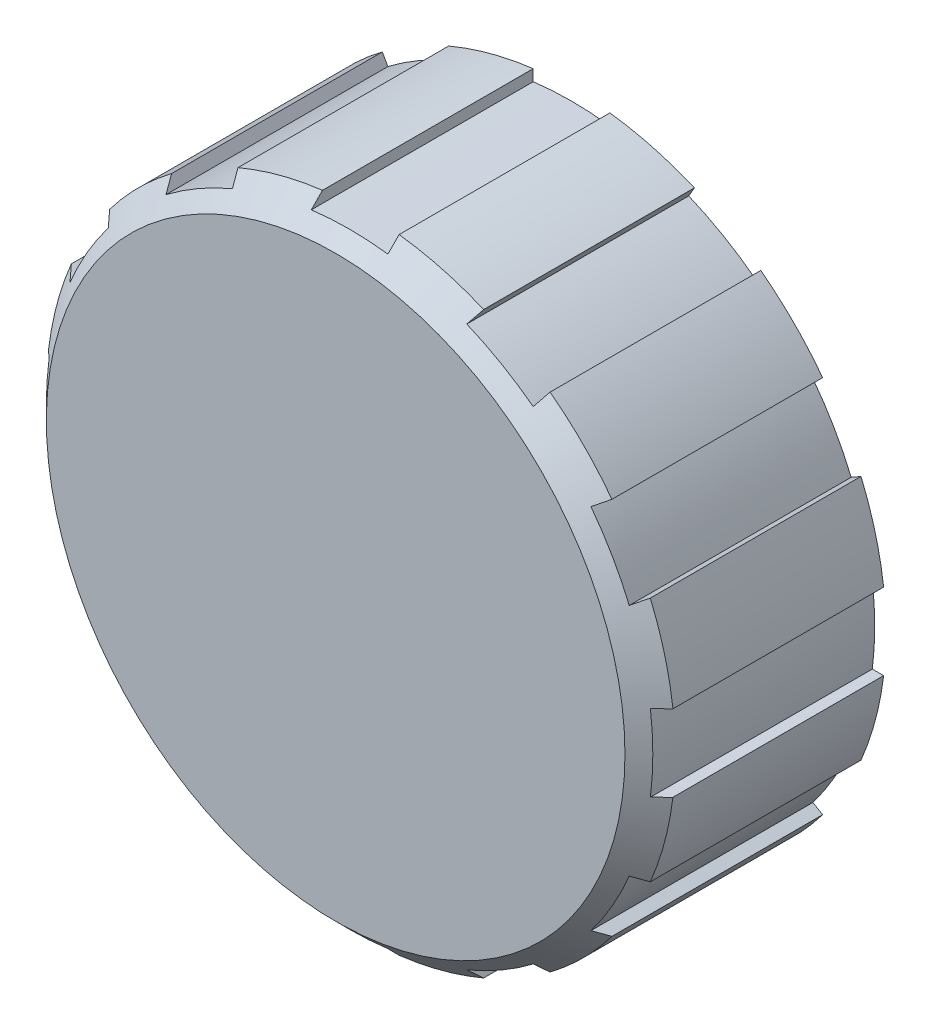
ISO-10303-21;
HEADER;
FILE_DESCRIPTION(('STEP AP214'),'2;1');
FILE_NAME('part.step','',(''),(''),'','','');
FILE_SCHEMA(('AUTOMOTIVE_DESIGN { 1 0 10303 214 1 1 1 1 }'));
ENDSEC;
DATA;
#1=APPLICATION_CONTEXT('core data for automotive mechanical design processes');
#2=APPLICATION_PROTOCOL_DEFINITION('international standard','automotive_design',2000,#1);
#3=PRODUCT_CONTEXT('',#1,'mechanical');
#4=PRODUCT('Part','Part','',(#3));
#5=PRODUCT_RELATED_PRODUCT_CATEGORY('part','',(#4));
#6=PRODUCT_DEFINITION_FORMATION('','',#4);
#7=PRODUCT_DEFINITION_CONTEXT('part definition',#1,'design');
#8=PRODUCT_DEFINITION('design','',#6,#7);
#9=PRODUCT_DEFINITION_SHAPE('','',#8);
#10=(LENGTH_UNIT() NAMED_UNIT(*) SI_UNIT(.MILLI.,.METRE.));
#11=(NAMED_UNIT(*) PLANE_ANGLE_UNIT() SI_UNIT($,.RADIAN.));
#12=(NAMED_UNIT(*) SI_UNIT($,.STERADIAN.) SOLID_ANGLE_UNIT());
#13=UNCERTAINTY_MEASURE_WITH_UNIT(LENGTH_MEASURE(1.E-05),#10,'distance_accuracy_value','');
#14=(GEOMETRIC_REPRESENTATION_CONTEXT(3) GLOBAL_UNCERTAINTY_ASSIGNED_CONTEXT((#13)) GLOBAL_UNIT_ASSIGNED_CONTEXT((#10,
#11,#12)) REPRESENTATION_CONTEXT('',''));
#15=CARTESIAN_POINT('',(0.,0.,0.));
#16=DIRECTION('',(0.,0.,1.));
#17=DIRECTION('',(1.,0.,0.));
#18=AXIS2_PLACEMENT_3D('',#15,#16,#17);
#19=CARTESIAN_POINT('',(0.,24.4015,0.));
#20=DIRECTION('',(0.,0.,1.));
#21=DIRECTION('',(1.,0.,0.));
#22=AXIS2_PLACEMENT_3D('',#19,#20,#21);
#23=PLANE('',#22);
#24=CARTESIAN_POINT('',(0.,0.,0.));
#25=DIRECTION('',(0.,0.,1.));
#26=DIRECTION('',(1.,0.,0.));
#27=AXIS2_PLACEMENT_3D('',#24,#25,#26);
#28=CIRCLE('',#27,24.4015);
#29=CARTESIAN_POINT('',(24.4015,0.,0.));
#30=VERTEX_POINT('',#29);
#31=EDGE_CURVE('E364',#30,#30,#28,.T.);
#32=ORIENTED_EDGE('',*,*,#31,.T.);
#33=EDGE_LOOP('',(#32));
#34=FACE_BOUND('',#33,.T.);
#35=DIRECTION('',(0.5,-0.866025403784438,0.));
#36=VECTOR('',#35,1.);
#37=CARTESIAN_POINT('',(-16.8508206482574,22.3617942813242,0.));
#38=LINE('',#37,#36);
#39=CARTESIAN_POINT('',(-16.8508206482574,22.3617942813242,0.));
#40=VERTEX_POINT('',#39);
#41=CARTESIAN_POINT('',(-16.3469250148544,21.4890214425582,0.));
#42=VERTEX_POINT('',#41);
#43=EDGE_CURVE('E551',#40,#42,#38,.T.);
#44=ORIENTED_EDGE('',*,*,#43,.T.);
#45=CARTESIAN_POINT('',(2.1163626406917E-13,-2.32452945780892E-13,0.));
#46=DIRECTION('',(0.,0.,-1.));
#47=DIRECTION('',(1.,0.,0.));
#48=AXIS2_PLACEMENT_3D('',#45,#46,#47);
#49=CIRCLE('',#48,27.);
#50=CARTESIAN_POINT('',(-10.4365759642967,24.9013630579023,0.));
#51=VERTEX_POINT('',#50);
#52=EDGE_CURVE('E553',#42,#51,#49,.T.);
#53=ORIENTED_EDGE('',*,*,#52,.T.);
#54=DIRECTION('',(-0.5,0.86602540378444,0.));
#55=VECTOR('',#54,1.);
#56=CARTESIAN_POINT('',(-10.4365759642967,24.9013630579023,0.));
#57=LINE('',#56,#55);
#58=CARTESIAN_POINT('',(-10.9404715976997,25.7741358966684,0.));
#59=VERTEX_POINT('',#58);
#60=EDGE_CURVE('E557',#51,#59,#57,.T.);
#61=ORIENTED_EDGE('',*,*,#60,.T.);
#62=CARTESIAN_POINT('',(0.,0.,0.));
#63=DIRECTION('',(0.,0.,1.));
#64=DIRECTION('',(1.,0.,0.));
#65=AXIS2_PLACEMENT_3D('',#62,#63,#64);
#66=CIRCLE('',#65,28.);
#67=CARTESIAN_POINT('',(-3.41234161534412,27.791292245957,0.));
#68=VERTEX_POINT('',#67);
#69=EDGE_CURVE('E896',#68,#59,#66,.T.);
#70=ORIENTED_EDGE('',*,*,#69,.F.);
#71=DIRECTION('',(0.,-1.,0.));
#72=VECTOR('',#71,1.);
#73=CARTESIAN_POINT('',(-3.41234161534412,27.791292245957,0.));
#74=LINE('',#73,#72);
#75=CARTESIAN_POINT('',(-3.41234161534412,26.7835009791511,0.));
#76=VERTEX_POINT('',#75);
#77=EDGE_CURVE('E569',#68,#76,#74,.T.);
#78=ORIENTED_EDGE('',*,*,#77,.T.);
#79=CARTESIAN_POINT('',(0.,0.,0.));
#80=DIRECTION('',(0.,0.,-1.));
#81=DIRECTION('',(1.,0.,0.));
#82=AXIS2_PLACEMENT_3D('',#79,#80,#81);
#83=CIRCLE('',#82,27.);
#84=CARTESIAN_POINT('',(3.41234161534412,26.7835009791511,0.));
#85=VERTEX_POINT('',#84);
#86=EDGE_CURVE('E572',#76,#85,#83,.T.);
#87=ORIENTED_EDGE('',*,*,#86,.T.);
#88=DIRECTION('',(0.,1.,0.));
#89=VECTOR('',#88,1.);
#90=CARTESIAN_POINT('',(3.41234161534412,26.7835009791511,0.));
#91=LINE('',#90,#89);
#92=CARTESIAN_POINT('',(3.41234161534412,27.791292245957,0.));
#93=VERTEX_POINT('',#92);
#94=EDGE_CURVE('E576',#85,#93,#91,.T.);
#95=ORIENTED_EDGE('',*,*,#94,.T.);
#96=CARTESIAN_POINT('',(10.9404715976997,25.7741358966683,0.));
#97=VERTEX_POINT('',#96);
#98=EDGE_CURVE('E900',#97,#93,#66,.T.);
#99=ORIENTED_EDGE('',*,*,#98,.F.);
#100=DIRECTION('',(-0.500000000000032,-0.86602540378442,0.));
#101=VECTOR('',#100,1.);
#102=CARTESIAN_POINT('',(10.9404715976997,25.7741358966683,0.));
#103=LINE('',#102,#101);
#104=CARTESIAN_POINT('',(10.4365759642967,24.9013630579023,0.));
#105=VERTEX_POINT('',#104);
#106=EDGE_CURVE('E586',#97,#105,#103,.T.);
#107=ORIENTED_EDGE('',*,*,#106,.T.);
#108=CARTESIAN_POINT('',(-1.02348685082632E-13,-3.98986399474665E-13,0.));
#109=DIRECTION('',(0.,0.,-1.));
#110=DIRECTION('',(1.,0.,0.));
#111=AXIS2_PLACEMENT_3D('',#108,#109,#110);
#112=CIRCLE('',#111,27.0000000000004);
#113=CARTESIAN_POINT('',(16.3469250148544,21.4890214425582,0.));
#114=VERTEX_POINT('',#113);
#115=EDGE_CURVE('E589',#105,#114,#112,.T.);
#116=ORIENTED_EDGE('',*,*,#115,.T.);
#117=DIRECTION('',(0.5,0.866025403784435,0.));
#118=VECTOR('',#117,1.);
#119=CARTESIAN_POINT('',(16.3469250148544,21.4890214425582,0.));
#120=LINE('',#119,#118);
#121=CARTESIAN_POINT('',(16.8508206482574,22.3617942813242,0.));
#122=VERTEX_POINT('',#121);
#123=EDGE_CURVE('E593',#114,#122,#120,.T.);
#124=ORIENTED_EDGE('',*,*,#123,.T.);
#125=CARTESIAN_POINT('',(22.3617942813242,16.8508206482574,0.));
#126=VERTEX_POINT('',#125);
#127=EDGE_CURVE('E365',#126,#122,#66,.T.);
#128=ORIENTED_EDGE('',*,*,#127,.F.);
#129=DIRECTION('',(-0.866025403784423,-0.500000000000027,0.));
#130=VECTOR('',#129,1.);
#131=CARTESIAN_POINT('',(22.3617942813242,16.8508206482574,0.));
#132=LINE('',#131,#130);
#133=CARTESIAN_POINT('',(21.4890214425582,16.3469250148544,0.));
#134=VERTEX_POINT('',#133);
#135=EDGE_CURVE('E604',#126,#134,#132,.T.);
#136=ORIENTED_EDGE('',*,*,#135,.T.);
#137=CARTESIAN_POINT('',(-1.17961196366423E-13,-1.00613961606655E-13,0.));
#138=DIRECTION('',(0.,0.,-1.));
#139=DIRECTION('',(1.,0.,0.));
#140=AXIS2_PLACEMENT_3D('',#137,#138,#139);
#141=CIRCLE('',#140,27.);
#142=CARTESIAN_POINT('',(24.9013630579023,10.4365759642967,0.));
#143=VERTEX_POINT('',#142);
#144=EDGE_CURVE('E607',#134,#143,#141,.T.);
#145=ORIENTED_EDGE('',*,*,#144,.T.);
#146=DIRECTION('',(0.866025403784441,0.5,0.));
#147=VECTOR('',#146,1.);
#148=CARTESIAN_POINT('',(24.9013630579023,10.4365759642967,0.));
#149=LINE('',#148,#147);
#150=CARTESIAN_POINT('',(25.7741358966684,10.9404715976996,0.));
#151=VERTEX_POINT('',#150);
#152=EDGE_CURVE('E611',#143,#151,#149,.T.);
#153=ORIENTED_EDGE('',*,*,#152,.T.);
#154=CARTESIAN_POINT('',(27.791292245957,3.4123416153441,0.));
#155=VERTEX_POINT('',#154);
#156=EDGE_CURVE('E360',#155,#151,#66,.T.);
#157=ORIENTED_EDGE('',*,*,#156,.F.);
#158=DIRECTION('',(-1.,0.,0.));
#159=VECTOR('',#158,1.);
#160=CARTESIAN_POINT('',(27.791292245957,3.4123416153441,0.));
#161=LINE('',#160,#159);
#162=CARTESIAN_POINT('',(26.7835009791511,3.4123416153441,0.));
#163=VERTEX_POINT('',#162);
#164=EDGE_CURVE('E622',#155,#163,#161,.T.);
#165=ORIENTED_EDGE('',*,*,#164,.T.);
#166=CARTESIAN_POINT('',(0.,0.,0.));
#167=DIRECTION('',(0.,0.,-1.));
#168=DIRECTION('',(1.,0.,0.));
#169=AXIS2_PLACEMENT_3D('',#166,#167,#168);
#170=CIRCLE('',#169,27.);
#171=CARTESIAN_POINT('',(26.7835009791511,-3.41234161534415,0.));
#172=VERTEX_POINT('',#171);
#173=EDGE_CURVE('E625',#163,#172,#170,.T.);
#174=ORIENTED_EDGE('',*,*,#173,.T.);
#175=DIRECTION('',(1.,0.,0.));
#176=VECTOR('',#175,1.);
#177=CARTESIAN_POINT('',(26.7835009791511,-3.41234161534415,0.));
#178=LINE('',#177,#176);
#179=CARTESIAN_POINT('',(27.791292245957,-3.41234161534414,0.));
#180=VERTEX_POINT('',#179);
#181=EDGE_CURVE('E629',#172,#180,#178,.T.);
#182=ORIENTED_EDGE('',*,*,#181,.T.);
#183=CARTESIAN_POINT('',(25.7741358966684,-10.9404715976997,0.));
#184=VERTEX_POINT('',#183);
#185=EDGE_CURVE('E366',#184,#180,#66,.T.);
#186=ORIENTED_EDGE('',*,*,#185,.F.);
#187=DIRECTION('',(-0.866025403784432,0.500000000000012,0.));
#188=VECTOR('',#187,1.);
#189=CARTESIAN_POINT('',(25.7741358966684,-10.9404715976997,0.));
#190=LINE('',#189,#188);
#191=CARTESIAN_POINT('',(24.9013630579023,-10.4365759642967,0.));
#192=VERTEX_POINT('',#191);
#193=EDGE_CURVE('E640',#184,#192,#190,.T.);
#194=ORIENTED_EDGE('',*,*,#193,.T.);
#195=CARTESIAN_POINT('',(4.40619762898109E-13,-1.47451495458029E-13,0.));
#196=DIRECTION('',(0.,0.,-1.));
#197=DIRECTION('',(1.,0.,0.));
#198=AXIS2_PLACEMENT_3D('',#195,#196,#197);
#199=CIRCLE('',#198,26.9999999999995);
#200=CARTESIAN_POINT('',(21.4890214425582,-16.3469250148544,0.));
#201=VERTEX_POINT('',#200);
#202=EDGE_CURVE('E643',#192,#201,#199,.T.);
#203=ORIENTED_EDGE('',*,*,#202,.T.);
#204=DIRECTION('',(0.866025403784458,-0.499999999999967,0.));
#205=VECTOR('',#204,1.);
#206=CARTESIAN_POINT('',(21.4890214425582,-16.3469250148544,0.));
#207=LINE('',#206,#205);
#208=CARTESIAN_POINT('',(22.3617942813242,-16.8508206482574,0.));
#209=VERTEX_POINT('',#208);
#210=EDGE_CURVE('E647',#201,#209,#207,.T.);
#211=ORIENTED_EDGE('',*,*,#210,.T.);
#212=CARTESIAN_POINT('',(16.8508206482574,-22.3617942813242,0.));
#213=VERTEX_POINT('',#212);
#214=EDGE_CURVE('E359',#213,#209,#66,.T.);
#215=ORIENTED_EDGE('',*,*,#214,.F.);
#216=DIRECTION('',(-0.500000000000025,0.866025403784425,0.));
#217=VECTOR('',#216,1.);
#218=CARTESIAN_POINT('',(16.8508206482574,-22.3617942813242,0.));
#219=LINE('',#218,#217);
#220=CARTESIAN_POINT('',(16.3469250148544,-21.4890214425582,0.));
#221=VERTEX_POINT('',#220);
#222=EDGE_CURVE('E658',#213,#221,#219,.T.);
#223=ORIENTED_EDGE('',*,*,#222,.T.);
#224=CARTESIAN_POINT('',(4.5102810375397E-13,-4.54497550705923E-13,0.));
#225=DIRECTION('',(0.,0.,-1.));
#226=DIRECTION('',(1.,0.,0.));
#227=AXIS2_PLACEMENT_3D('',#224,#225,#226);
#228=CIRCLE('',#227,26.9999999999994);
#229=CARTESIAN_POINT('',(10.4365759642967,-24.9013630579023,0.));
#230=VERTEX_POINT('',#229);
#231=EDGE_CURVE('E661',#221,#230,#228,.T.);
#232=ORIENTED_EDGE('',*,*,#231,.T.);
#233=DIRECTION('',(0.499999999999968,-0.866025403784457,0.));
#234=VECTOR('',#233,1.);
#235=CARTESIAN_POINT('',(10.4365759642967,-24.9013630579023,0.));
#236=LINE('',#235,#234);
#237=CARTESIAN_POINT('',(10.9404715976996,-25.7741358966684,0.));
#238=VERTEX_POINT('',#237);
#239=EDGE_CURVE('E665',#230,#238,#236,.T.);
#240=ORIENTED_EDGE('',*,*,#239,.T.);
#241=CARTESIAN_POINT('',(3.41234161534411,-27.7912922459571,0.));
#242=VERTEX_POINT('',#241);
#243=EDGE_CURVE('E354',#242,#238,#66,.T.);
#244=ORIENTED_EDGE('',*,*,#243,.F.);
#245=DIRECTION('',(0.,1.,0.));
#246=VECTOR('',#245,1.);
#247=CARTESIAN_POINT('',(3.41234161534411,-27.7912922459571,0.));
#248=LINE('',#247,#246);
#249=CARTESIAN_POINT('',(3.41234161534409,-26.7835009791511,0.));
#250=VERTEX_POINT('',#249);
#251=EDGE_CURVE('E346',#242,#250,#248,.T.);
#252=ORIENTED_EDGE('',*,*,#251,.T.);
#253=CARTESIAN_POINT('',(0.,-1.87350135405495E-13,0.));
#254=DIRECTION('',(0.,0.,-1.));
#255=DIRECTION('',(1.,0.,0.));
#256=AXIS2_PLACEMENT_3D('',#253,#254,#255);
#257=CIRCLE('',#256,27.);
#258=CARTESIAN_POINT('',(-3.41234161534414,-26.7835009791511,0.));
#259=VERTEX_POINT('',#258);
#260=EDGE_CURVE('E678',#250,#259,#257,.T.);
#261=ORIENTED_EDGE('',*,*,#260,.T.);
#262=DIRECTION('',(0.,-1.,0.));
#263=VECTOR('',#262,1.);
#264=CARTESIAN_POINT('',(-3.41234161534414,-26.7835009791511,0.));
#265=LINE('',#264,#263);
#266=CARTESIAN_POINT('',(-3.41234161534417,-27.791292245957,0.));
#267=VERTEX_POINT('',#266);
#268=EDGE_CURVE('E352',#259,#267,#265,.T.);
#269=ORIENTED_EDGE('',*,*,#268,.T.);
#270=CARTESIAN_POINT('',(-10.9404715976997,-25.7741358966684,0.));
#271=VERTEX_POINT('',#270);
#272=EDGE_CURVE('E343',#271,#267,#66,.T.);
#273=ORIENTED_EDGE('',*,*,#272,.F.);
#274=DIRECTION('',(0.499999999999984,0.866025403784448,0.));
#275=VECTOR('',#274,1.);
#276=CARTESIAN_POINT('',(-10.9404715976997,-25.7741358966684,0.));
#277=LINE('',#276,#275);
#278=CARTESIAN_POINT('',(-10.4365759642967,-24.9013630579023,0.));
#279=VERTEX_POINT('',#278);
#280=EDGE_CURVE('E324',#271,#279,#277,.T.);
#281=ORIENTED_EDGE('',*,*,#280,.T.);
#282=CARTESIAN_POINT('',(0.,1.17961196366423E-13,0.));
#283=DIRECTION('',(0.,0.,-1.));
#284=DIRECTION('',(1.,0.,0.));
#285=AXIS2_PLACEMENT_3D('',#282,#283,#284);
#286=CIRCLE('',#285,27.);
#287=CARTESIAN_POINT('',(-16.3469250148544,-21.4890214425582,0.));
#288=VERTEX_POINT('',#287);
#289=EDGE_CURVE('E335',#279,#288,#286,.T.);
#290=ORIENTED_EDGE('',*,*,#289,.T.);
#291=DIRECTION('',(-0.5,-0.866025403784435,0.));
#292=VECTOR('',#291,1.);
#293=CARTESIAN_POINT('',(-16.3469250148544,-21.4890214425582,0.));
#294=LINE('',#293,#292);
#295=CARTESIAN_POINT('',(-16.8508206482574,-22.3617942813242,0.));
#296=VERTEX_POINT('',#295);
#297=EDGE_CURVE('E509',#288,#296,#294,.T.);
#298=ORIENTED_EDGE('',*,*,#297,.T.);
#299=CARTESIAN_POINT('',(-22.3617942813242,-16.8508206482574,0.));
#300=VERTEX_POINT('',#299);
#301=EDGE_CURVE('E353',#300,#296,#66,.T.);
#302=ORIENTED_EDGE('',*,*,#301,.F.);
#303=DIRECTION('',(0.866025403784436,0.5,0.));
#304=VECTOR('',#303,1.);
#305=CARTESIAN_POINT('',(-22.3617942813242,-16.8508206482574,0.));
#306=LINE('',#305,#304);
#307=CARTESIAN_POINT('',(-21.4890214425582,-16.3469250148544,0.));
#308=VERTEX_POINT('',#307);
#309=EDGE_CURVE('E517',#300,#308,#306,.T.);
#310=ORIENTED_EDGE('',*,*,#309,.T.);
#311=CARTESIAN_POINT('',(-4.19803081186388E-13,-4.1286418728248E-13,0.));
#312=DIRECTION('',(0.,0.,-1.));
#313=DIRECTION('',(1.,0.,0.));
#314=AXIS2_PLACEMENT_3D('',#311,#312,#313);
#315=CIRCLE('',#314,26.9999999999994);
#316=CARTESIAN_POINT('',(-24.9013630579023,-10.4365759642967,0.));
#317=VERTEX_POINT('',#316);
#318=EDGE_CURVE('E520',#308,#317,#315,.T.);
#319=ORIENTED_EDGE('',*,*,#318,.T.);
#320=DIRECTION('',(-0.866025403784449,-0.499999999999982,0.));
#321=VECTOR('',#320,1.);
#322=CARTESIAN_POINT('',(-24.9013630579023,-10.4365759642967,0.));
#323=LINE('',#322,#321);
#324=CARTESIAN_POINT('',(-25.7741358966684,-10.9404715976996,0.));
#325=VERTEX_POINT('',#324);
#326=EDGE_CURVE('E524',#317,#325,#323,.T.);
#327=ORIENTED_EDGE('',*,*,#326,.T.);
#328=CARTESIAN_POINT('',(-27.791292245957,-3.41234161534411,0.));
#329=VERTEX_POINT('',#328);
#330=EDGE_CURVE('E357',#329,#325,#66,.T.);
#331=ORIENTED_EDGE('',*,*,#330,.F.);
#332=DIRECTION('',(1.,0.,0.));
#333=VECTOR('',#332,1.);
#334=CARTESIAN_POINT('',(-27.791292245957,-3.41234161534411,0.));
#335=LINE('',#334,#333);
#336=CARTESIAN_POINT('',(-26.7835009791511,-3.4123416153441,0.));
#337=VERTEX_POINT('',#336);
#338=EDGE_CURVE('E505',#329,#337,#335,.T.);
#339=ORIENTED_EDGE('',*,*,#338,.T.);
#340=CARTESIAN_POINT('',(0.,0.,0.));
#341=DIRECTION('',(0.,0.,-1.));
#342=DIRECTION('',(1.,0.,0.));
#343=AXIS2_PLACEMENT_3D('',#340,#341,#342);
#344=CIRCLE('',#343,27.);
#345=CARTESIAN_POINT('',(-26.7835009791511,3.41234161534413,0.));
#346=VERTEX_POINT('',#345);
#347=EDGE_CURVE('E537',#337,#346,#344,.T.);
#348=ORIENTED_EDGE('',*,*,#347,.T.);
#349=DIRECTION('',(-1.,0.,0.));
#350=VECTOR('',#349,1.);
#351=CARTESIAN_POINT('',(-26.7835009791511,3.41234161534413,0.));
#352=LINE('',#351,#350);
#353=CARTESIAN_POINT('',(-27.791292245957,3.41234161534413,0.));
#354=VERTEX_POINT('',#353);
#355=EDGE_CURVE('E540',#346,#354,#352,.T.);
#356=ORIENTED_EDGE('',*,*,#355,.T.);
#357=CARTESIAN_POINT('',(-25.7741358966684,10.9404715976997,0.));
#358=VERTEX_POINT('',#357);
#359=EDGE_CURVE('E889',#358,#354,#66,.T.);
#360=ORIENTED_EDGE('',*,*,#359,.F.);
#361=DIRECTION('',(0.866025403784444,-0.499999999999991,0.));
#362=VECTOR('',#361,1.);
#363=CARTESIAN_POINT('',(-25.7741358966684,10.9404715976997,0.));
#364=LINE('',#363,#362);
#365=CARTESIAN_POINT('',(-24.9013630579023,10.4365759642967,0.));
#366=VERTEX_POINT('',#365);
#367=EDGE_CURVE('E568',#358,#366,#364,.T.);
#368=ORIENTED_EDGE('',*,*,#367,.T.);
#369=CARTESIAN_POINT('',(-2.1163626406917E-13,0.,0.));
#370=DIRECTION('',(0.,0.,-1.));
#371=DIRECTION('',(1.,0.,0.));
#372=AXIS2_PLACEMENT_3D('',#369,#370,#371);
#373=CIRCLE('',#372,27.);
#374=CARTESIAN_POINT('',(-21.4890214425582,16.3469250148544,0.));
#375=VERTEX_POINT('',#374);
#376=EDGE_CURVE('E691',#366,#375,#373,.T.);
#377=ORIENTED_EDGE('',*,*,#376,.T.);
#378=DIRECTION('',(-0.866025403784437,0.5,0.));
#379=VECTOR('',#378,1.);
#380=CARTESIAN_POINT('',(-21.4890214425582,16.3469250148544,0.));
#381=LINE('',#380,#379);
#382=CARTESIAN_POINT('',(-22.3617942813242,16.8508206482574,0.));
#383=VERTEX_POINT('',#382);
#384=EDGE_CURVE('E694',#375,#383,#381,.T.);
#385=ORIENTED_EDGE('',*,*,#384,.T.);
#386=EDGE_CURVE('E891',#40,#383,#66,.T.);
#387=ORIENTED_EDGE('',*,*,#386,.F.);
#388=EDGE_LOOP('',(#44,#53,#61,#70,#78,#87,#95,#99,#107,#116,#124,#128,#136,#145,#153,#157,#165,
#174,#182,#186,#194,#203,#211,#215,#223,#232,#240,#244,#252,#261,#269,#273,#281,#290,#298,#302,
#310,#319,#327,#331,#339,#348,#356,#360,#368,#377,#385,#387));
#389=FACE_BOUND('',#388,.T.);
#390=ADVANCED_FACE('F15',(#34,#389),#23,.F.);
#391=CARTESIAN_POINT('',(0.,0.,21.));
#392=DIRECTION('',(0.,0.,1.));
#393=DIRECTION('',(1.,0.,0.));
#394=AXIS2_PLACEMENT_3D('',#391,#392,#393);
#395=CYLINDRICAL_SURFACE('',#394,28.);
#396=DIRECTION('',(0.,0.,-1.));
#397=VECTOR('',#396,1.);
#398=CARTESIAN_POINT('',(-16.8508206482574,22.3617942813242,30.));
#399=LINE('',#398,#397);
#400=CARTESIAN_POINT('',(-16.8508206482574,22.3617942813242,18.76));
#401=VERTEX_POINT('',#400);
#402=EDGE_CURVE('E565',#401,#40,#399,.T.);
#403=ORIENTED_EDGE('',*,*,#402,.T.);
#404=ORIENTED_EDGE('',*,*,#386,.T.);
#405=DIRECTION('',(0.,0.,-1.));
#406=VECTOR('',#405,1.);
#407=CARTESIAN_POINT('',(-22.3617942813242,16.8508206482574,30.));
#408=LINE('',#407,#406);
#409=CARTESIAN_POINT('',(-22.3617942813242,16.8508206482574,18.76));
#410=VERTEX_POINT('',#409);
#411=EDGE_CURVE('E697',#410,#383,#408,.T.);
#412=ORIENTED_EDGE('',*,*,#411,.F.);
#413=CARTESIAN_POINT('',(0.,0.,18.76));
#414=DIRECTION('',(0.,0.,1.));
#415=DIRECTION('',(1.,0.,0.));
#416=AXIS2_PLACEMENT_3D('',#413,#414,#415);
#417=CIRCLE('',#416,28.);
#418=EDGE_CURVE('E735',#401,#410,#417,.T.);
#419=ORIENTED_EDGE('',*,*,#418,.F.);
#420=EDGE_LOOP('',(#403,#404,#412,#419));
#421=FACE_BOUND('',#420,.T.);
#422=ADVANCED_FACE('F474',(#421),#395,.T.);
#423=DIRECTION('',(0.,0.,-1.));
#424=VECTOR('',#423,1.);
#425=CARTESIAN_POINT('',(-10.9404715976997,25.7741358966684,30.));
#426=LINE('',#425,#424);
#427=CARTESIAN_POINT('',(-10.9404715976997,25.7741358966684,18.76));
#428=VERTEX_POINT('',#427);
#429=EDGE_CURVE('E560',#428,#59,#426,.T.);
#430=ORIENTED_EDGE('',*,*,#429,.F.);
#431=CARTESIAN_POINT('',(-3.41234161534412,27.791292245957,18.76));
#432=VERTEX_POINT('',#431);
#433=EDGE_CURVE('E730',#432,#428,#417,.T.);
#434=ORIENTED_EDGE('',*,*,#433,.F.);
#435=DIRECTION('',(0.,0.,-1.));
#436=VECTOR('',#435,1.);
#437=CARTESIAN_POINT('',(-3.41234161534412,27.791292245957,30.));
#438=LINE('',#437,#436);
#439=EDGE_CURVE('E554',#432,#68,#438,.T.);
#440=ORIENTED_EDGE('',*,*,#439,.T.);
#441=ORIENTED_EDGE('',*,*,#69,.T.);
#442=EDGE_LOOP('',(#430,#434,#440,#441));
#443=FACE_BOUND('',#442,.T.);
#444=ADVANCED_FACE('F481',(#443),#395,.T.);
#445=DIRECTION('',(0.,0.,-1.));
#446=VECTOR('',#445,1.);
#447=CARTESIAN_POINT('',(3.41234161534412,27.791292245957,30.));
#448=LINE('',#447,#446);
#449=CARTESIAN_POINT('',(3.41234161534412,27.791292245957,18.76));
#450=VERTEX_POINT('',#449);
#451=EDGE_CURVE('E579',#450,#93,#448,.T.);
#452=ORIENTED_EDGE('',*,*,#451,.F.);
#453=CARTESIAN_POINT('',(10.9404715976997,25.7741358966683,18.76));
#454=VERTEX_POINT('',#453);
#455=EDGE_CURVE('E725',#454,#450,#417,.T.);
#456=ORIENTED_EDGE('',*,*,#455,.F.);
#457=DIRECTION('',(0.,0.,-1.));
#458=VECTOR('',#457,1.);
#459=CARTESIAN_POINT('',(10.9404715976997,25.7741358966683,30.));
#460=LINE('',#459,#458);
#461=EDGE_CURVE('E573',#454,#97,#460,.T.);
#462=ORIENTED_EDGE('',*,*,#461,.T.);
#463=ORIENTED_EDGE('',*,*,#98,.T.);
#464=EDGE_LOOP('',(#452,#456,#462,#463));
#465=FACE_BOUND('',#464,.T.);
#466=ADVANCED_FACE('F989',(#465),#395,.T.);
#467=DIRECTION('',(0.,0.,-1.));
#468=VECTOR('',#467,1.);
#469=CARTESIAN_POINT('',(16.8508206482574,22.3617942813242,30.));
#470=LINE('',#469,#468);
#471=CARTESIAN_POINT('',(16.8508206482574,22.3617942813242,18.76));
#472=VERTEX_POINT('',#471);
#473=EDGE_CURVE('E596',#472,#122,#470,.T.);
#474=ORIENTED_EDGE('',*,*,#473,.F.);
#475=CARTESIAN_POINT('',(22.3617942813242,16.8508206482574,18.76));
#476=VERTEX_POINT('',#475);
#477=EDGE_CURVE('E719',#476,#472,#417,.T.);
#478=ORIENTED_EDGE('',*,*,#477,.F.);
#479=DIRECTION('',(0.,0.,-1.));
#480=VECTOR('',#479,1.);
#481=CARTESIAN_POINT('',(22.3617942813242,16.8508206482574,30.));
#482=LINE('',#481,#480);
#483=EDGE_CURVE('E590',#476,#126,#482,.T.);
#484=ORIENTED_EDGE('',*,*,#483,.T.);
#485=ORIENTED_EDGE('',*,*,#127,.T.);
#486=EDGE_LOOP('',(#474,#478,#484,#485));
#487=FACE_BOUND('',#486,.T.);
#488=ADVANCED_FACE('F912',(#487),#395,.T.);
#489=DIRECTION('',(0.,0.,-1.));
#490=VECTOR('',#489,1.);
#491=CARTESIAN_POINT('',(25.7741358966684,10.9404715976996,30.));
#492=LINE('',#491,#490);
#493=CARTESIAN_POINT('',(25.7741358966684,10.9404715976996,18.76));
#494=VERTEX_POINT('',#493);
#495=EDGE_CURVE('E614',#494,#151,#492,.T.);
#496=ORIENTED_EDGE('',*,*,#495,.F.);
#497=CARTESIAN_POINT('',(27.791292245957,3.4123416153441,18.76));
#498=VERTEX_POINT('',#497);
#499=EDGE_CURVE('E367',#498,#494,#417,.T.);
#500=ORIENTED_EDGE('',*,*,#499,.F.);
#501=DIRECTION('',(0.,0.,-1.));
#502=VECTOR('',#501,1.);
#503=CARTESIAN_POINT('',(27.791292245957,3.4123416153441,30.));
#504=LINE('',#503,#502);
#505=EDGE_CURVE('E608',#498,#155,#504,.T.);
#506=ORIENTED_EDGE('',*,*,#505,.T.);
#507=ORIENTED_EDGE('',*,*,#156,.T.);
#508=EDGE_LOOP('',(#496,#500,#506,#507));
#509=FACE_BOUND('',#508,.T.);
#510=ADVANCED_FACE('F1044',(#509),#395,.T.);
#511=DIRECTION('',(0.,0.,-1.));
#512=VECTOR('',#511,1.);
#513=CARTESIAN_POINT('',(27.791292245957,-3.41234161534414,30.));
#514=LINE('',#513,#512);
#515=CARTESIAN_POINT('',(27.791292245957,-3.41234161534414,18.76));
#516=VERTEX_POINT('',#515);
#517=EDGE_CURVE('E632',#516,#180,#514,.T.);
#518=ORIENTED_EDGE('',*,*,#517,.F.);
#519=CARTESIAN_POINT('',(25.7741358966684,-10.9404715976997,18.76));
#520=VERTEX_POINT('',#519);
#521=EDGE_CURVE('E707',#520,#516,#417,.T.);
#522=ORIENTED_EDGE('',*,*,#521,.F.);
#523=DIRECTION('',(0.,0.,-1.));
#524=VECTOR('',#523,1.);
#525=CARTESIAN_POINT('',(25.7741358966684,-10.9404715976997,30.));
#526=LINE('',#525,#524);
#527=EDGE_CURVE('E626',#520,#184,#526,.T.);
#528=ORIENTED_EDGE('',*,*,#527,.T.);
#529=ORIENTED_EDGE('',*,*,#185,.T.);
#530=EDGE_LOOP('',(#518,#522,#528,#529));
#531=FACE_BOUND('',#530,.T.);
#532=ADVANCED_FACE('F1038',(#531),#395,.T.);
#533=DIRECTION('',(0.,0.,-1.));
#534=VECTOR('',#533,1.);
#535=CARTESIAN_POINT('',(22.3617942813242,-16.8508206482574,30.));
#536=LINE('',#535,#534);
#537=CARTESIAN_POINT('',(22.3617942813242,-16.8508206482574,18.76));
#538=VERTEX_POINT('',#537);
#539=EDGE_CURVE('E650',#538,#209,#536,.T.);
#540=ORIENTED_EDGE('',*,*,#539,.F.);
#541=CARTESIAN_POINT('',(16.8508206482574,-22.3617942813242,18.76));
#542=VERTEX_POINT('',#541);
#543=EDGE_CURVE('E711',#542,#538,#417,.T.);
#544=ORIENTED_EDGE('',*,*,#543,.F.);
#545=DIRECTION('',(0.,0.,-1.));
#546=VECTOR('',#545,1.);
#547=CARTESIAN_POINT('',(16.8508206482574,-22.3617942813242,30.));
#548=LINE('',#547,#546);
#549=EDGE_CURVE('E644',#542,#213,#548,.T.);
#550=ORIENTED_EDGE('',*,*,#549,.T.);
#551=ORIENTED_EDGE('',*,*,#214,.T.);
#552=EDGE_LOOP('',(#540,#544,#550,#551));
#553=FACE_BOUND('',#552,.T.);
#554=ADVANCED_FACE('F1033',(#553),#395,.T.);
#555=DIRECTION('',(0.,0.,-1.));
#556=VECTOR('',#555,1.);
#557=CARTESIAN_POINT('',(10.9404715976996,-25.7741358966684,30.));
#558=LINE('',#557,#556);
#559=CARTESIAN_POINT('',(10.9404715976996,-25.7741358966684,18.76));
#560=VERTEX_POINT('',#559);
#561=EDGE_CURVE('E668',#560,#238,#558,.T.);
#562=ORIENTED_EDGE('',*,*,#561,.F.);
#563=CARTESIAN_POINT('',(3.41234161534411,-27.7912922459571,18.76));
#564=VERTEX_POINT('',#563);
#565=EDGE_CURVE('E717',#564,#560,#417,.T.);
#566=ORIENTED_EDGE('',*,*,#565,.F.);
#567=DIRECTION('',(0.,0.,-1.));
#568=VECTOR('',#567,1.);
#569=CARTESIAN_POINT('',(3.41234161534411,-27.7912922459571,30.));
#570=LINE('',#569,#568);
#571=EDGE_CURVE('E662',#564,#242,#570,.T.);
#572=ORIENTED_EDGE('',*,*,#571,.T.);
#573=ORIENTED_EDGE('',*,*,#243,.T.);
#574=EDGE_LOOP('',(#562,#566,#572,#573));
#575=FACE_BOUND('',#574,.T.);
#576=ADVANCED_FACE('F769',(#575),#395,.T.);
#577=DIRECTION('',(0.,0.,-1.));
#578=VECTOR('',#577,1.);
#579=CARTESIAN_POINT('',(-3.41234161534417,-27.791292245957,30.));
#580=LINE('',#579,#578);
#581=CARTESIAN_POINT('',(-3.41234161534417,-27.791292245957,18.76));
#582=VERTEX_POINT('',#581);
#583=EDGE_CURVE('E681',#582,#267,#580,.T.);
#584=ORIENTED_EDGE('',*,*,#583,.F.);
#585=CARTESIAN_POINT('',(-10.9404715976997,-25.7741358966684,18.76));
#586=VERTEX_POINT('',#585);
#587=EDGE_CURVE('E345',#586,#582,#417,.T.);
#588=ORIENTED_EDGE('',*,*,#587,.F.);
#589=DIRECTION('',(0.,0.,-1.));
#590=VECTOR('',#589,1.);
#591=CARTESIAN_POINT('',(-10.9404715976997,-25.7741358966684,30.));
#592=LINE('',#591,#590);
#593=EDGE_CURVE('E327',#586,#271,#592,.T.);
#594=ORIENTED_EDGE('',*,*,#593,.T.);
#595=ORIENTED_EDGE('',*,*,#272,.T.);
#596=EDGE_LOOP('',(#584,#588,#594,#595));
#597=FACE_BOUND('',#596,.T.);
#598=ADVANCED_FACE('F342',(#597),#395,.T.);
#599=DIRECTION('',(0.,0.,-1.));
#600=VECTOR('',#599,1.);
#601=CARTESIAN_POINT('',(-16.8508206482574,-22.3617942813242,30.));
#602=LINE('',#601,#600);
#603=CARTESIAN_POINT('',(-16.8508206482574,-22.3617942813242,18.76));
#604=VERTEX_POINT('',#603);
#605=EDGE_CURVE('E512',#604,#296,#602,.T.);
#606=ORIENTED_EDGE('',*,*,#605,.F.);
#607=CARTESIAN_POINT('',(-22.3617942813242,-16.8508206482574,18.76));
#608=VERTEX_POINT('',#607);
#609=EDGE_CURVE('E750',#608,#604,#417,.T.);
#610=ORIENTED_EDGE('',*,*,#609,.F.);
#611=DIRECTION('',(0.,0.,-1.));
#612=VECTOR('',#611,1.);
#613=CARTESIAN_POINT('',(-22.3617942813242,-16.8508206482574,30.));
#614=LINE('',#613,#612);
#615=EDGE_CURVE('E336',#608,#300,#614,.T.);
#616=ORIENTED_EDGE('',*,*,#615,.T.);
#617=ORIENTED_EDGE('',*,*,#301,.T.);
#618=EDGE_LOOP('',(#606,#610,#616,#617));
#619=FACE_BOUND('',#618,.T.);
#620=ADVANCED_FACE('F878',(#619),#395,.T.);
#621=DIRECTION('',(0.,0.,-1.));
#622=VECTOR('',#621,1.);
#623=CARTESIAN_POINT('',(-25.7741358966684,-10.9404715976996,30.));
#624=LINE('',#623,#622);
#625=CARTESIAN_POINT('',(-25.7741358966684,-10.9404715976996,18.76));
#626=VERTEX_POINT('',#625);
#627=EDGE_CURVE('E527',#626,#325,#624,.T.);
#628=ORIENTED_EDGE('',*,*,#627,.F.);
#629=CARTESIAN_POINT('',(-27.791292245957,-3.41234161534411,18.76));
#630=VERTEX_POINT('',#629);
#631=EDGE_CURVE('E745',#630,#626,#417,.T.);
#632=ORIENTED_EDGE('',*,*,#631,.F.);
#633=DIRECTION('',(0.,0.,-1.));
#634=VECTOR('',#633,1.);
#635=CARTESIAN_POINT('',(-27.791292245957,-3.41234161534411,30.));
#636=LINE('',#635,#634);
#637=EDGE_CURVE('E521',#630,#329,#636,.T.);
#638=ORIENTED_EDGE('',*,*,#637,.T.);
#639=ORIENTED_EDGE('',*,*,#330,.T.);
#640=EDGE_LOOP('',(#628,#632,#638,#639));
#641=FACE_BOUND('',#640,.T.);
#642=ADVANCED_FACE('F888',(#641),#395,.T.);
#643=DIRECTION('',(0.,0.,-1.));
#644=VECTOR('',#643,1.);
#645=CARTESIAN_POINT('',(-27.791292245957,3.41234161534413,30.));
#646=LINE('',#645,#644);
#647=CARTESIAN_POINT('',(-27.791292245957,3.41234161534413,18.76));
#648=VERTEX_POINT('',#647);
#649=EDGE_CURVE('E543',#648,#354,#646,.T.);
#650=ORIENTED_EDGE('',*,*,#649,.F.);
#651=CARTESIAN_POINT('',(-25.7741358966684,10.9404715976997,18.76));
#652=VERTEX_POINT('',#651);
#653=EDGE_CURVE('E740',#652,#648,#417,.T.);
#654=ORIENTED_EDGE('',*,*,#653,.F.);
#655=DIRECTION('',(0.,0.,-1.));
#656=VECTOR('',#655,1.);
#657=CARTESIAN_POINT('',(-25.7741358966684,10.9404715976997,30.));
#658=LINE('',#657,#656);
#659=EDGE_CURVE('E703',#652,#358,#658,.T.);
#660=ORIENTED_EDGE('',*,*,#659,.T.);
#661=ORIENTED_EDGE('',*,*,#359,.T.);
#662=EDGE_LOOP('',(#650,#654,#660,#661));
#663=FACE_BOUND('',#662,.T.);
#664=ADVANCED_FACE('F483',(#663),#395,.T.);
#665=CARTESIAN_POINT('',(0.,0.,18.76));
#666=DIRECTION('',(0.,0.,-1.));
#667=DIRECTION('',(-1.,0.,0.));
#668=AXIS2_PLACEMENT_3D('',#665,#666,#667);
#669=CONICAL_SURFACE('',#668,28.,0.785398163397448);
#670=CARTESIAN_POINT('',(0.,0.,21.));
#671=DIRECTION('',(0.,0.,1.));
#672=DIRECTION('',(1.,0.,0.));
#673=AXIS2_PLACEMENT_3D('',#670,#671,#672);
#674=CIRCLE('',#673,25.76);
#675=CARTESIAN_POINT('',(25.76,0.,21.0000000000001));
#676=VERTEX_POINT('',#675);
#677=EDGE_CURVE('E705',#676,#676,#674,.T.);
#678=ORIENTED_EDGE('',*,*,#677,.F.);
#679=EDGE_LOOP('',(#678));
#680=FACE_BOUND('',#679,.T.);
#681=CARTESIAN_POINT('',(-16.8509213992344,22.3619687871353,18.7598));
#682=CARTESIAN_POINT('',(-16.7669146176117,22.2164647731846,18.9265620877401));
#683=CARTESIAN_POINT('',(-16.6829019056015,22.0709504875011,19.0933122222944));
#684=CARTESIAN_POINT('',(-16.5148646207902,21.7799013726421,19.426788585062));
#685=CARTESIAN_POINT('',(-16.4308400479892,21.6343665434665,19.5935148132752));
#686=CARTESIAN_POINT('',(-16.3468095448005,21.4888214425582,19.7602290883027));
#687=B_SPLINE_CURVE_WITH_KNOTS('',3,(#681,#682,#683,#684,#685,#686),.UNSPECIFIED.,.F.,.F.,(4,2,
4),(0.,0.710171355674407,1.42034271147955),.UNSPECIFIED.);
#688=CARTESIAN_POINT('',(-16.3469250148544,21.4890214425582,19.7599999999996));
#689=VERTEX_POINT('',#688);
#690=EDGE_CURVE('E10',#401,#689,#687,.T.);
#691=ORIENTED_EDGE('',*,*,#690,.F.);
#692=ORIENTED_EDGE('',*,*,#418,.T.);
#693=CARTESIAN_POINT('',(-21.4888214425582,16.3468095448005,19.7602290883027));
#694=CARTESIAN_POINT('',(-21.6343665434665,16.4308400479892,19.5935148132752));
#695=CARTESIAN_POINT('',(-21.7799013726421,16.5148646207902,19.4267885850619));
#696=CARTESIAN_POINT('',(-22.0709504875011,16.6829019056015,19.0933122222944));
#697=CARTESIAN_POINT('',(-22.2164647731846,16.7669146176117,18.9265620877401));
#698=CARTESIAN_POINT('',(-22.3619687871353,16.8509213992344,18.7598));
#699=B_SPLINE_CURVE_WITH_KNOTS('',3,(#693,#694,#695,#696,#697,#698),.UNSPECIFIED.,.F.,.F.,(4,2,
4),(0.,0.710171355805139,1.42034271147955),.UNSPECIFIED.);
#700=CARTESIAN_POINT('',(-21.4890214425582,16.3469250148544,19.76));
#701=VERTEX_POINT('',#700);
#702=EDGE_CURVE('E374',#701,#410,#699,.T.);
#703=ORIENTED_EDGE('',*,*,#702,.F.);
#704=CARTESIAN_POINT('',(0.,0.,19.7600000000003));
#705=DIRECTION('',(0.,0.,-1.));
#706=DIRECTION('',(-1.,0.,0.));
#707=AXIS2_PLACEMENT_3D('',#704,#705,#706);
#708=CIRCLE('',#707,27.);
#709=CARTESIAN_POINT('',(-24.9013630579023,10.4365759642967,19.76));
#710=VERTEX_POINT('',#709);
#711=EDGE_CURVE('E381',#710,#701,#708,.T.);
#712=ORIENTED_EDGE('',*,*,#711,.F.);
#713=CARTESIAN_POINT('',(-25.7743104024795,10.9405723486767,18.7598));
#714=CARTESIAN_POINT('',(-25.6288063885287,10.856565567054,18.9265620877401));
#715=CARTESIAN_POINT('',(-25.4832921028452,10.7725528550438,19.0933122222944));
#716=CARTESIAN_POINT('',(-25.1922429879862,10.6045155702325,19.4267885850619));
#717=CARTESIAN_POINT('',(-25.0467081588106,10.5204909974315,19.5935148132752));
#718=CARTESIAN_POINT('',(-24.9011630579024,10.4364604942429,19.7602290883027));
#719=B_SPLINE_CURVE_WITH_KNOTS('',3,(#713,#714,#715,#716,#717,#718),.UNSPECIFIED.,.F.,.F.,(4,2,
4),(0.,0.710171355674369,1.42034271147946),.UNSPECIFIED.);
#720=EDGE_CURVE('E406',#652,#710,#719,.T.);
#721=ORIENTED_EDGE('',*,*,#720,.F.);
#722=ORIENTED_EDGE('',*,*,#653,.T.);
#723=CARTESIAN_POINT('',(-24.3270348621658,3.41234161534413,22.1948071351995));
#724=CARTESIAN_POINT('',(-24.8208902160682,3.41234161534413,21.7057364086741));
#725=CARTESIAN_POINT('',(-25.314605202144,3.41234161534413,21.2165239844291));
#726=CARTESIAN_POINT('',(-26.3017931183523,3.41234161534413,20.2378551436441));
#727=CARTESIAN_POINT('',(-26.7952660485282,3.41234161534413,19.7483987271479));
#728=CARTESIAN_POINT('',(-27.7820086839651,3.41234161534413,18.7692811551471));
#729=CARTESIAN_POINT('',(-28.2752783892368,3.41234161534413,18.2796199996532));
#730=CARTESIAN_POINT('',(-29.2616427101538,3.41234161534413,17.3001211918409));
#731=CARTESIAN_POINT('',(-29.7547373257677,3.41234161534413,16.810283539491));
#732=CARTESIAN_POINT('',(-30.2477583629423,3.41234161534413,16.3203718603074));
#733=B_SPLINE_CURVE_WITH_KNOTS('',3,(#723,#724,#725,#726,#727,#728,#729,#730,#731,#732),
.UNSPECIFIED.,.F.,.F.,(4,2,2,2,4),(0.,2.08512572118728,4.17025106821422,6.25537630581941,
8.34050191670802),.UNSPECIFIED.);
#734=CARTESIAN_POINT('',(-26.7835009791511,3.41234161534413,19.76));
#735=VERTEX_POINT('',#734);
#736=EDGE_CURVE('E412',#735,#648,#733,.T.);
#737=ORIENTED_EDGE('',*,*,#736,.F.);
#738=CARTESIAN_POINT('',(0.,0.,19.76));
#739=DIRECTION('',(0.,0.,-1.));
#740=DIRECTION('',(-1.,0.,0.));
#741=AXIS2_PLACEMENT_3D('',#738,#739,#740);
#742=CIRCLE('',#741,27.);
#743=CARTESIAN_POINT('',(-26.7835009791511,-3.4123416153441,19.76));
#744=VERTEX_POINT('',#743);
#745=EDGE_CURVE('E419',#744,#735,#742,.T.);
#746=ORIENTED_EDGE('',*,*,#745,.F.);
#747=CARTESIAN_POINT('',(-30.2477583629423,-3.41234161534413,16.3203718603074));
#748=CARTESIAN_POINT('',(-29.7547373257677,-3.41234161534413,16.810283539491));
#749=CARTESIAN_POINT('',(-29.2616427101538,-3.41234161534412,17.3001211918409));
#750=CARTESIAN_POINT('',(-28.2752783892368,-3.41234161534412,18.2796199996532));
#751=CARTESIAN_POINT('',(-27.7820086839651,-3.41234161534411,18.7692811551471));
#752=CARTESIAN_POINT('',(-26.7952660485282,-3.41234161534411,19.7483987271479));
#753=CARTESIAN_POINT('',(-26.3017931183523,-3.41234161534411,20.2378551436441));
#754=CARTESIAN_POINT('',(-25.314605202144,-3.4123416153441,21.2165239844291));
#755=CARTESIAN_POINT('',(-24.8208902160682,-3.4123416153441,21.7057364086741));
#756=CARTESIAN_POINT('',(-24.3270348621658,-3.41234161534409,22.1948071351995));
#757=B_SPLINE_CURVE_WITH_KNOTS('',3,(#747,#748,#749,#750,#751,#752,#753,#754,#755,#756),
.UNSPECIFIED.,.F.,.F.,(4,2,2,2,4),(0.,2.08512561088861,4.1702508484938,6.25537619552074,
8.34050191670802),.UNSPECIFIED.);
#758=EDGE_CURVE('E441',#630,#744,#757,.T.);
#759=ORIENTED_EDGE('',*,*,#758,.F.);
#760=ORIENTED_EDGE('',*,*,#631,.T.);
#761=CARTESIAN_POINT('',(-24.9011630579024,-10.4364604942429,19.7602290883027));
#762=CARTESIAN_POINT('',(-25.0467081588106,-10.5204909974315,19.5935148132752));
#763=CARTESIAN_POINT('',(-25.1922429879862,-10.6045155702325,19.4267885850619));
#764=CARTESIAN_POINT('',(-25.4832921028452,-10.7725528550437,19.0933122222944));
#765=CARTESIAN_POINT('',(-25.6288063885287,-10.856565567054,18.9265620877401));
#766=CARTESIAN_POINT('',(-25.7743104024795,-10.9405723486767,18.7598));
#767=B_SPLINE_CURVE_WITH_KNOTS('',3,(#761,#762,#763,#764,#765,#766),.UNSPECIFIED.,.F.,.F.,(4,2,
4),(0.,0.710171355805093,1.42034271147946),.UNSPECIFIED.);
#768=CARTESIAN_POINT('',(-24.9013630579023,-10.4365759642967,19.76));
#769=VERTEX_POINT('',#768);
#770=EDGE_CURVE('E447',#769,#626,#767,.T.);
#771=ORIENTED_EDGE('',*,*,#770,.F.);
#772=CARTESIAN_POINT('',(0.,0.,19.7600000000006));
#773=DIRECTION('',(0.,0.,-1.));
#774=DIRECTION('',(-1.,0.,0.));
#775=AXIS2_PLACEMENT_3D('',#772,#773,#774);
#776=CIRCLE('',#775,26.9999999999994);
#777=CARTESIAN_POINT('',(-21.4890214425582,-16.3469250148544,19.7600000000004));
#778=VERTEX_POINT('',#777);
#779=EDGE_CURVE('E454',#778,#769,#776,.T.);
#780=ORIENTED_EDGE('',*,*,#779,.F.);
#781=CARTESIAN_POINT('',(-22.3619687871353,-16.8509213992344,18.7598));
#782=CARTESIAN_POINT('',(-22.2164647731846,-16.7669146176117,18.9265620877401));
#783=CARTESIAN_POINT('',(-22.0709504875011,-16.6829019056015,19.0933122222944));
#784=CARTESIAN_POINT('',(-21.7799013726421,-16.5148646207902,19.4267885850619));
#785=CARTESIAN_POINT('',(-21.6343665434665,-16.4308400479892,19.5935148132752));
#786=CARTESIAN_POINT('',(-21.4888214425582,-16.3468095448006,19.7602290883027));
#787=B_SPLINE_CURVE_WITH_KNOTS('',3,(#781,#782,#783,#784,#785,#786),.UNSPECIFIED.,.F.,.F.,(4,2,
4),(0.,0.710171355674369,1.42034271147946),.UNSPECIFIED.);
#788=EDGE_CURVE('E868',#608,#778,#787,.T.);
#789=ORIENTED_EDGE('',*,*,#788,.F.);
#790=ORIENTED_EDGE('',*,*,#609,.T.);
#791=CARTESIAN_POINT('',(-16.3468095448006,-21.4888214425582,19.7602290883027));
#792=CARTESIAN_POINT('',(-16.4308400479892,-21.6343665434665,19.5935148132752));
#793=CARTESIAN_POINT('',(-16.5148646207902,-21.7799013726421,19.4267885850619));
#794=CARTESIAN_POINT('',(-16.6829019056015,-22.0709504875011,19.0933122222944));
#795=CARTESIAN_POINT('',(-16.7669146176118,-22.2164647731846,18.9265620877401));
#796=CARTESIAN_POINT('',(-16.8509213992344,-22.3619687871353,18.7598));
#797=B_SPLINE_CURVE_WITH_KNOTS('',3,(#791,#792,#793,#794,#795,#796),.UNSPECIFIED.,.F.,.F.,(4,2,
4),(0.,0.710171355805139,1.42034271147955),.UNSPECIFIED.);
#798=CARTESIAN_POINT('',(-16.3469250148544,-21.4890214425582,19.76));
#799=VERTEX_POINT('',#798);
#800=EDGE_CURVE('E862',#799,#604,#797,.T.);
#801=ORIENTED_EDGE('',*,*,#800,.F.);
#802=CARTESIAN_POINT('',(0.,0.,19.76));
#803=DIRECTION('',(0.,0.,-1.));
#804=DIRECTION('',(-1.,0.,0.));
#805=AXIS2_PLACEMENT_3D('',#802,#803,#804);
#806=CIRCLE('',#805,27.);
#807=CARTESIAN_POINT('',(-10.4365759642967,-24.9013630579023,19.76));
#808=VERTEX_POINT('',#807);
#809=EDGE_CURVE('E867',#808,#799,#806,.T.);
#810=ORIENTED_EDGE('',*,*,#809,.F.);
#811=CARTESIAN_POINT('',(-10.9405723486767,-25.7743104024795,18.7598));
#812=CARTESIAN_POINT('',(-10.8565655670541,-25.6288063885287,18.9265620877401));
#813=CARTESIAN_POINT('',(-10.7725528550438,-25.4832921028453,19.0933122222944));
#814=CARTESIAN_POINT('',(-10.6045155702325,-25.1922429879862,19.4267885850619));
#815=CARTESIAN_POINT('',(-10.5204909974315,-25.0467081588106,19.5935148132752));
#816=CARTESIAN_POINT('',(-10.4364604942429,-24.9011630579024,19.7602290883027));
#817=B_SPLINE_CURVE_WITH_KNOTS('',3,(#811,#812,#813,#814,#815,#816),.UNSPECIFIED.,.F.,.F.,(4,2,
4),(0.,0.7101713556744,1.42034271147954),.UNSPECIFIED.);
#818=EDGE_CURVE('E825',#586,#808,#817,.T.);
#819=ORIENTED_EDGE('',*,*,#818,.F.);
#820=ORIENTED_EDGE('',*,*,#587,.T.);
#821=CARTESIAN_POINT('',(-3.41234161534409,-24.3270348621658,22.1948071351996));
#822=CARTESIAN_POINT('',(-3.41234161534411,-24.8208902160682,21.7057364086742));
#823=CARTESIAN_POINT('',(-3.41234161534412,-25.314605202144,21.2165239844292));
#824=CARTESIAN_POINT('',(-3.41234161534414,-26.3017931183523,20.2378551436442));
#825=CARTESIAN_POINT('',(-3.41234161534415,-26.7952660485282,19.748398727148));
#826=CARTESIAN_POINT('',(-3.41234161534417,-27.7820086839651,18.7692811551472));
#827=CARTESIAN_POINT('',(-3.41234161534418,-28.2752783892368,18.2796199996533));
#828=CARTESIAN_POINT('',(-3.4123416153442,-29.2616427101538,17.300121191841));
#829=CARTESIAN_POINT('',(-3.4123416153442,-29.7547373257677,16.8102835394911));
#830=CARTESIAN_POINT('',(-3.41234161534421,-30.2477583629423,16.3203718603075));
#831=B_SPLINE_CURVE_WITH_KNOTS('',3,(#821,#822,#823,#824,#825,#826,#827,#828,#829,#830),
.UNSPECIFIED.,.F.,.F.,(4,2,2,2,4),(0.,2.08512572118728,4.17025106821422,6.25537630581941,
8.34050191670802),.UNSPECIFIED.);
#832=CARTESIAN_POINT('',(-3.41234161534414,-26.7835009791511,19.76));
#833=VERTEX_POINT('',#832);
#834=EDGE_CURVE('E817',#833,#582,#831,.T.);
#835=ORIENTED_EDGE('',*,*,#834,.F.);
#836=CARTESIAN_POINT('',(0.,0.,19.76));
#837=DIRECTION('',(0.,0.,-1.));
#838=DIRECTION('',(-1.,0.,0.));
#839=AXIS2_PLACEMENT_3D('',#836,#837,#838);
#840=CIRCLE('',#839,27.);
#841=CARTESIAN_POINT('',(3.41234161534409,-26.7835009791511,19.76));
#842=VERTEX_POINT('',#841);
#843=EDGE_CURVE('E824',#842,#833,#840,.T.);
#844=ORIENTED_EDGE('',*,*,#843,.F.);
#845=CARTESIAN_POINT('',(3.41234161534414,-30.2477583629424,16.3203718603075));
#846=CARTESIAN_POINT('',(3.41234161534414,-29.7547373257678,16.810283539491));
#847=CARTESIAN_POINT('',(3.41234161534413,-29.2616427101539,17.300121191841));
#848=CARTESIAN_POINT('',(3.41234161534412,-28.2752783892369,18.2796199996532));
#849=CARTESIAN_POINT('',(3.41234161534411,-27.7820086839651,18.7692811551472));
#850=CARTESIAN_POINT('',(3.4123416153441,-26.7952660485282,19.748398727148));
#851=CARTESIAN_POINT('',(3.41234161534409,-26.3017931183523,20.2378551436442));
#852=CARTESIAN_POINT('',(3.41234161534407,-25.314605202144,21.2165239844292));
#853=CARTESIAN_POINT('',(3.41234161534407,-24.8208902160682,21.7057364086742));
#854=CARTESIAN_POINT('',(3.41234161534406,-24.3270348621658,22.1948071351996));
#855=B_SPLINE_CURVE_WITH_KNOTS('',3,(#845,#846,#847,#848,#849,#850,#851,#852,#853,#854),
.UNSPECIFIED.,.F.,.F.,(4,2,2,2,4),(0.,2.08512561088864,4.17025084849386,6.25537619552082,
8.34050191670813),.UNSPECIFIED.);
#856=EDGE_CURVE('E766',#564,#842,#855,.T.);
#857=ORIENTED_EDGE('',*,*,#856,.F.);
#858=ORIENTED_EDGE('',*,*,#565,.T.);
#859=CARTESIAN_POINT('',(10.4364604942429,-24.9011630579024,19.7602290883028));
#860=CARTESIAN_POINT('',(10.5204909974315,-25.0467081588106,19.5935148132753));
#861=CARTESIAN_POINT('',(10.6045155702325,-25.1922429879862,19.426788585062));
#862=CARTESIAN_POINT('',(10.7725528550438,-25.4832921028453,19.0933122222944));
#863=CARTESIAN_POINT('',(10.856565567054,-25.6288063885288,18.9265620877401));
#864=CARTESIAN_POINT('',(10.9405723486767,-25.7743104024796,18.7598));
#865=B_SPLINE_CURVE_WITH_KNOTS('',3,(#859,#860,#861,#862,#863,#864),.UNSPECIFIED.,.F.,.F.,(4,2,
4),(0.,0.710171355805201,1.42034271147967),.UNSPECIFIED.);
#866=CARTESIAN_POINT('',(10.4365759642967,-24.9013630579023,19.76));
#867=VERTEX_POINT('',#866);
#868=EDGE_CURVE('E764',#867,#560,#865,.T.);
#869=ORIENTED_EDGE('',*,*,#868,.F.);
#870=CARTESIAN_POINT('',(0.,0.,19.7600000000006));
#871=DIRECTION('',(0.,0.,-1.));
#872=DIRECTION('',(-1.,0.,0.));
#873=AXIS2_PLACEMENT_3D('',#870,#871,#872);
#874=CIRCLE('',#873,26.9999999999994);
#875=CARTESIAN_POINT('',(16.3469250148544,-21.4890214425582,19.7600000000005));
#876=VERTEX_POINT('',#875);
#877=EDGE_CURVE('E780',#876,#867,#874,.T.);
#878=ORIENTED_EDGE('',*,*,#877,.F.);
#879=CARTESIAN_POINT('',(16.8509213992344,-22.3619687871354,18.7598));
#880=CARTESIAN_POINT('',(16.7669146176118,-22.2164647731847,18.9265620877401));
#881=CARTESIAN_POINT('',(16.6829019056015,-22.0709504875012,19.0933122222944));
#882=CARTESIAN_POINT('',(16.5148646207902,-21.7799013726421,19.426788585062));
#883=CARTESIAN_POINT('',(16.4308400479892,-21.6343665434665,19.5935148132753));
#884=CARTESIAN_POINT('',(16.3468095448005,-21.4888214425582,19.7602290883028));
#885=B_SPLINE_CURVE_WITH_KNOTS('',3,(#879,#880,#881,#882,#883,#884),.UNSPECIFIED.,.F.,.F.,(4,2,
4),(0.,0.710171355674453,1.42034271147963),.UNSPECIFIED.);
#886=EDGE_CURVE('E782',#542,#876,#885,.T.);
#887=ORIENTED_EDGE('',*,*,#886,.F.);
#888=ORIENTED_EDGE('',*,*,#543,.T.);
#889=CARTESIAN_POINT('',(21.4888214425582,-16.3468095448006,19.7602290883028));
#890=CARTESIAN_POINT('',(21.6343665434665,-16.4308400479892,19.5935148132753));
#891=CARTESIAN_POINT('',(21.7799013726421,-16.5148646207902,19.426788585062));
#892=CARTESIAN_POINT('',(22.0709504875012,-16.6829019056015,19.0933122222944));
#893=CARTESIAN_POINT('',(22.2164647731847,-16.7669146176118,18.9265620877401));
#894=CARTESIAN_POINT('',(22.3619687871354,-16.8509213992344,18.7598));
#895=B_SPLINE_CURVE_WITH_KNOTS('',3,(#889,#890,#891,#892,#893,#894),.UNSPECIFIED.,.F.,.F.,(4,2,
4),(0.,0.710171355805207,1.42034271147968),.UNSPECIFIED.);
#896=CARTESIAN_POINT('',(21.4890214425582,-16.3469250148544,19.76));
#897=VERTEX_POINT('',#896);
#898=EDGE_CURVE('E784',#897,#538,#895,.T.);
#899=ORIENTED_EDGE('',*,*,#898,.F.);
#900=CARTESIAN_POINT('',(0.,0.,19.7600000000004));
#901=DIRECTION('',(0.,0.,-1.));
#902=DIRECTION('',(-1.,0.,0.));
#903=AXIS2_PLACEMENT_3D('',#900,#901,#902);
#904=CIRCLE('',#903,26.9999999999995);
#905=CARTESIAN_POINT('',(24.9013630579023,-10.4365759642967,19.7600000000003));
#906=VERTEX_POINT('',#905);
#907=EDGE_CURVE('E1058',#906,#897,#904,.T.);
#908=ORIENTED_EDGE('',*,*,#907,.F.);
#909=CARTESIAN_POINT('',(25.7743104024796,-10.9405723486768,18.7598));
#910=CARTESIAN_POINT('',(25.6288063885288,-10.8565655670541,18.9265620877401));
#911=CARTESIAN_POINT('',(25.4832921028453,-10.7725528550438,19.0933122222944));
#912=CARTESIAN_POINT('',(25.1922429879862,-10.6045155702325,19.426788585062));
#913=CARTESIAN_POINT('',(25.0467081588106,-10.5204909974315,19.5935148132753));
#914=CARTESIAN_POINT('',(24.9011630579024,-10.4364604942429,19.7602290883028));
#915=B_SPLINE_CURVE_WITH_KNOTS('',3,(#909,#910,#911,#912,#913,#914),.UNSPECIFIED.,.F.,.F.,(4,2,
4),(0.,0.710171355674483,1.4203427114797),.UNSPECIFIED.);
#916=EDGE_CURVE('E1060',#520,#906,#915,.T.);
#917=ORIENTED_EDGE('',*,*,#916,.F.);
#918=ORIENTED_EDGE('',*,*,#521,.T.);
#919=CARTESIAN_POINT('',(24.3270348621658,-3.41234161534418,22.1948071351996));
#920=CARTESIAN_POINT('',(24.8208902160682,-3.41234161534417,21.7057364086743));
#921=CARTESIAN_POINT('',(25.314605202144,-3.41234161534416,21.2165239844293));
#922=CARTESIAN_POINT('',(26.3017931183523,-3.41234161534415,20.2378551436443));
#923=CARTESIAN_POINT('',(26.7952660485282,-3.41234161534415,19.7483987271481));
#924=CARTESIAN_POINT('',(27.7820086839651,-3.41234161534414,18.7692811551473));
#925=CARTESIAN_POINT('',(28.2752783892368,-3.41234161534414,18.2796199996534));
#926=CARTESIAN_POINT('',(29.2616427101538,-3.41234161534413,17.3001211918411));
#927=CARTESIAN_POINT('',(29.7547373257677,-3.41234161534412,16.8102835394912));
#928=CARTESIAN_POINT('',(30.2477583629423,-3.41234161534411,16.3203718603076));
#929=B_SPLINE_CURVE_WITH_KNOTS('',3,(#919,#920,#921,#922,#923,#924,#925,#926,#927,#928),
.UNSPECIFIED.,.F.,.F.,(4,2,2,2,4),(0.,2.08512572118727,4.1702510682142,6.25537630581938,
8.34050191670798),.UNSPECIFIED.);
#930=CARTESIAN_POINT('',(26.7835009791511,-3.41234161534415,19.76));
#931=VERTEX_POINT('',#930);
#932=EDGE_CURVE('E1061',#931,#516,#929,.T.);
#933=ORIENTED_EDGE('',*,*,#932,.F.);
#934=CARTESIAN_POINT('',(0.,0.,19.76));
#935=DIRECTION('',(0.,0.,-1.));
#936=DIRECTION('',(-1.,0.,0.));
#937=AXIS2_PLACEMENT_3D('',#934,#935,#936);
#938=CIRCLE('',#937,27.);
#939=CARTESIAN_POINT('',(26.7835009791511,3.4123416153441,19.76));
#940=VERTEX_POINT('',#939);
#941=EDGE_CURVE('E1419',#940,#931,#938,.T.);
#942=ORIENTED_EDGE('',*,*,#941,.F.);
#943=CARTESIAN_POINT('',(30.2477583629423,3.41234161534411,16.3203718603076));
#944=CARTESIAN_POINT('',(29.7547373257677,3.41234161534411,16.8102835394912));
#945=CARTESIAN_POINT('',(29.2616427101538,3.4123416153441,17.3001211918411));
#946=CARTESIAN_POINT('',(28.2752783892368,3.4123416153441,18.2796199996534));
#947=CARTESIAN_POINT('',(27.7820086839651,3.4123416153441,18.7692811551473));
#948=CARTESIAN_POINT('',(26.7952660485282,3.4123416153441,19.7483987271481));
#949=CARTESIAN_POINT('',(26.3017931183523,3.4123416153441,20.2378551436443));
#950=CARTESIAN_POINT('',(25.314605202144,3.41234161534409,21.2165239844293));
#951=CARTESIAN_POINT('',(24.8208902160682,3.41234161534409,21.7057364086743));
#952=CARTESIAN_POINT('',(24.3270348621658,3.41234161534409,22.1948071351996));
#953=B_SPLINE_CURVE_WITH_KNOTS('',3,(#943,#944,#945,#946,#947,#948,#949,#950,#951,#952),
.UNSPECIFIED.,.F.,.F.,(4,2,2,2,4),(0.,2.08512561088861,4.17025084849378,6.25537619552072,
8.34050191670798),.UNSPECIFIED.);
#954=EDGE_CURVE('E1417',#498,#940,#953,.T.);
#955=ORIENTED_EDGE('',*,*,#954,.F.);
#956=ORIENTED_EDGE('',*,*,#499,.T.);
#957=CARTESIAN_POINT('',(24.9011630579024,10.4364604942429,19.7602290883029));
#958=CARTESIAN_POINT('',(25.0467081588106,10.5204909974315,19.5935148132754));
#959=CARTESIAN_POINT('',(25.1922429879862,10.6045155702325,19.426788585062));
#960=CARTESIAN_POINT('',(25.4832921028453,10.7725528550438,19.0933122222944));
#961=CARTESIAN_POINT('',(25.6288063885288,10.8565655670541,18.9265620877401));
#962=CARTESIAN_POINT('',(25.7743104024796,10.9405723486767,18.7598));
#963=B_SPLINE_CURVE_WITH_KNOTS('',3,(#957,#958,#959,#960,#961,#962),.UNSPECIFIED.,.F.,.F.,(4,2,
4),(0.,0.710171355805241,1.42034271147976),.UNSPECIFIED.);
#964=CARTESIAN_POINT('',(24.9013630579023,10.4365759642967,19.76));
#965=VERTEX_POINT('',#964);
#966=EDGE_CURVE('E1412',#965,#494,#963,.T.);
#967=ORIENTED_EDGE('',*,*,#966,.F.);
#968=CARTESIAN_POINT('',(0.,0.,19.76));
#969=DIRECTION('',(0.,0.,-1.));
#970=DIRECTION('',(-1.,0.,0.));
#971=AXIS2_PLACEMENT_3D('',#968,#969,#970);
#972=CIRCLE('',#971,27.);
#973=CARTESIAN_POINT('',(21.4890214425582,16.3469250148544,19.7599999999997));
#974=VERTEX_POINT('',#973);
#975=EDGE_CURVE('E925',#974,#965,#972,.T.);
#976=ORIENTED_EDGE('',*,*,#975,.F.);
#977=CARTESIAN_POINT('',(22.3619687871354,16.8509213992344,18.7598));
#978=CARTESIAN_POINT('',(22.2164647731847,16.7669146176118,18.9265620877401));
#979=CARTESIAN_POINT('',(22.0709504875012,16.6829019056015,19.0933122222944));
#980=CARTESIAN_POINT('',(21.7799013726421,16.5148646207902,19.426788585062));
#981=CARTESIAN_POINT('',(21.6343665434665,16.4308400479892,19.5935148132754));
#982=CARTESIAN_POINT('',(21.4888214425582,16.3468095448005,19.7602290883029));
#983=B_SPLINE_CURVE_WITH_KNOTS('',3,(#977,#978,#979,#980,#981,#982),.UNSPECIFIED.,.F.,.F.,(4,2,
4),(0.,0.710171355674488,1.4203427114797),.UNSPECIFIED.);
#984=EDGE_CURVE('E921',#476,#974,#983,.T.);
#985=ORIENTED_EDGE('',*,*,#984,.F.);
#986=ORIENTED_EDGE('',*,*,#477,.T.);
#987=CARTESIAN_POINT('',(16.3468095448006,21.4888214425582,19.7602290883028));
#988=CARTESIAN_POINT('',(16.4308400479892,21.6343665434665,19.5935148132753));
#989=CARTESIAN_POINT('',(16.5148646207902,21.7799013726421,19.426788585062));
#990=CARTESIAN_POINT('',(16.6829019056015,22.0709504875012,19.0933122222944));
#991=CARTESIAN_POINT('',(16.7669146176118,22.2164647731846,18.9265620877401));
#992=CARTESIAN_POINT('',(16.8509213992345,22.3619687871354,18.7598));
#993=B_SPLINE_CURVE_WITH_KNOTS('',3,(#987,#988,#989,#990,#991,#992),.UNSPECIFIED.,.F.,.F.,(4,2,
4),(0.,0.710171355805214,1.4203427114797),.UNSPECIFIED.);
#994=CARTESIAN_POINT('',(16.3469250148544,21.4890214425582,19.76));
#995=VERTEX_POINT('',#994);
#996=EDGE_CURVE('E918',#995,#472,#993,.T.);
#997=ORIENTED_EDGE('',*,*,#996,.F.);
#998=CARTESIAN_POINT('',(0.,0.,19.7599999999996));
#999=DIRECTION('',(0.,0.,-1.));
#1000=DIRECTION('',(-1.,0.,0.));
#1001=AXIS2_PLACEMENT_3D('',#998,#999,#1000);
#1002=CIRCLE('',#1001,27.0000000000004);
#1003=CARTESIAN_POINT('',(10.4365759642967,24.9013630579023,19.7599999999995));
#1004=VERTEX_POINT('',#1003);
#1005=EDGE_CURVE('E920',#1004,#995,#1002,.T.);
#1006=ORIENTED_EDGE('',*,*,#1005,.F.);
#1007=CARTESIAN_POINT('',(10.9405723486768,25.7743104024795,18.7598));
#1008=CARTESIAN_POINT('',(10.8565655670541,25.6288063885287,18.9265620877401));
#1009=CARTESIAN_POINT('',(10.7725528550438,25.4832921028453,19.0933122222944));
#1010=CARTESIAN_POINT('',(10.6045155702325,25.1922429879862,19.426788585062));
#1011=CARTESIAN_POINT('',(10.5204909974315,25.0467081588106,19.5935148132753));
#1012=CARTESIAN_POINT('',(10.4364604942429,24.9011630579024,19.7602290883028));
#1013=B_SPLINE_CURVE_WITH_KNOTS('',3,(#1007,#1008,#1009,#1010,#1011,#1012),.UNSPECIFIED.,.F.,
.F.,(4,2,4),(0.,0.710171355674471,1.42034271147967),.UNSPECIFIED.);
#1014=EDGE_CURVE('E923',#454,#1004,#1013,.T.);
#1015=ORIENTED_EDGE('',*,*,#1014,.F.);
#1016=ORIENTED_EDGE('',*,*,#455,.T.);
#1017=CARTESIAN_POINT('',(3.41234161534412,24.3270348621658,22.1948071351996));
#1018=CARTESIAN_POINT('',(3.41234161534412,24.8208902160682,21.7057364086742));
#1019=CARTESIAN_POINT('',(3.41234161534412,25.314605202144,21.2165239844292));
#1020=CARTESIAN_POINT('',(3.41234161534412,26.3017931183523,20.2378551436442));
#1021=CARTESIAN_POINT('',(3.41234161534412,26.7952660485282,19.748398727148));
#1022=CARTESIAN_POINT('',(3.41234161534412,27.7820086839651,18.7692811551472));
#1023=CARTESIAN_POINT('',(3.41234161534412,28.2752783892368,18.2796199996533));
#1024=CARTESIAN_POINT('',(3.41234161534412,29.2616427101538,17.300121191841));
#1025=CARTESIAN_POINT('',(3.41234161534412,29.7547373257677,16.8102835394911));
#1026=CARTESIAN_POINT('',(3.41234161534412,30.2477583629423,16.3203718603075));
#1027=B_SPLINE_CURVE_WITH_KNOTS('',3,(#1017,#1018,#1019,#1020,#1021,#1022,#1023,#1024,#1025,
#1026),.UNSPECIFIED.,.F.,.F.,(4,2,2,2,4),(0.,2.08512572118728,4.17025106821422,6.25537630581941,
8.34050191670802),.UNSPECIFIED.);
#1028=CARTESIAN_POINT('',(3.41234161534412,26.7835009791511,19.76));
#1029=VERTEX_POINT('',#1028);
#1030=EDGE_CURVE('E963',#1029,#450,#1027,.T.);
#1031=ORIENTED_EDGE('',*,*,#1030,.F.);
#1032=CARTESIAN_POINT('',(0.,0.,19.76));
#1033=DIRECTION('',(0.,0.,-1.));
#1034=DIRECTION('',(-1.,0.,0.));
#1035=AXIS2_PLACEMENT_3D('',#1032,#1033,#1034);
#1036=CIRCLE('',#1035,27.);
#1037=CARTESIAN_POINT('',(-3.41234161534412,26.7835009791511,19.76));
#1038=VERTEX_POINT('',#1037);
#1039=EDGE_CURVE('E970',#1038,#1029,#1036,.T.);
#1040=ORIENTED_EDGE('',*,*,#1039,.F.);
#1041=CARTESIAN_POINT('',(-3.41234161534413,30.2477583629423,16.3203718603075));
#1042=CARTESIAN_POINT('',(-3.41234161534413,29.7547373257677,16.8102835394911));
#1043=CARTESIAN_POINT('',(-3.41234161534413,29.2616427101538,17.300121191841));
#1044=CARTESIAN_POINT('',(-3.41234161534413,28.2752783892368,18.2796199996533));
#1045=CARTESIAN_POINT('',(-3.41234161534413,27.7820086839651,18.7692811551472));
#1046=CARTESIAN_POINT('',(-3.41234161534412,26.7952660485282,19.748398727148));
#1047=CARTESIAN_POINT('',(-3.41234161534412,26.3017931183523,20.2378551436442));
#1048=CARTESIAN_POINT('',(-3.41234161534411,25.314605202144,21.2165239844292));
#1049=CARTESIAN_POINT('',(-3.41234161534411,24.8208902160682,21.7057364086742));
#1050=CARTESIAN_POINT('',(-3.41234161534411,24.3270348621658,22.1948071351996));
#1051=B_SPLINE_CURVE_WITH_KNOTS('',3,(#1041,#1042,#1043,#1044,#1045,#1046,#1047,#1048,#1049,
#1050),.UNSPECIFIED.,.F.,.F.,(4,2,2,2,4),(0.,2.08512561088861,4.1702508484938,6.25537619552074,
8.34050191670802),.UNSPECIFIED.);
#1052=EDGE_CURVE('E988',#432,#1038,#1051,.T.);
#1053=ORIENTED_EDGE('',*,*,#1052,.F.);
#1054=ORIENTED_EDGE('',*,*,#433,.T.);
#1055=CARTESIAN_POINT('',(-10.4364604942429,24.9011630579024,19.7602290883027));
#1056=CARTESIAN_POINT('',(-10.5204909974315,25.0467081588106,19.5935148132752));
#1057=CARTESIAN_POINT('',(-10.6045155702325,25.1922429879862,19.426788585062));
#1058=CARTESIAN_POINT('',(-10.7725528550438,25.4832921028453,19.0933122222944));
#1059=CARTESIAN_POINT('',(-10.856565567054,25.6288063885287,18.9265620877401));
#1060=CARTESIAN_POINT('',(-10.9405723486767,25.7743104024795,18.7598));
#1061=B_SPLINE_CURVE_WITH_KNOTS('',3,(#1055,#1056,#1057,#1058,#1059,#1060),.UNSPECIFIED.,.F.,
.F.,(4,2,4),(0.,0.710171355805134,1.42034271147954),.UNSPECIFIED.);
#1062=CARTESIAN_POINT('',(-10.4365759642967,24.9013630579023,19.76));
#1063=VERTEX_POINT('',#1062);
#1064=EDGE_CURVE('E990',#1063,#428,#1061,.T.);
#1065=ORIENTED_EDGE('',*,*,#1064,.F.);
#1066=CARTESIAN_POINT('',(0.,0.,19.7599999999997));
#1067=DIRECTION('',(0.,0.,-1.));
#1068=DIRECTION('',(-1.,0.,0.));
#1069=AXIS2_PLACEMENT_3D('',#1066,#1067,#1068);
#1070=CIRCLE('',#1069,27.);
#1071=EDGE_CURVE('E29',#689,#1063,#1070,.T.);
#1072=ORIENTED_EDGE('',*,*,#1071,.F.);
#1073=EDGE_LOOP('',(#691,#692,#703,#712,#721,#722,#737,#746,#759,#760,#771,#780,#789,#790,#801,
#810,#819,#820,#835,#844,#857,#858,#869,#878,#887,#888,#899,#908,#917,#918,#933,#942,#955,#956,
#967,#976,#985,#986,#997,#1006,#1015,#1016,#1031,#1040,#1053,#1054,#1065,#1072));
#1074=FACE_BOUND('',#1073,.T.);
#1075=ADVANCED_FACE('F383',(#680,#1074),#669,.T.);
#1076=CARTESIAN_POINT('',(0.,23.9015,2.));
#1077=DIRECTION('',(0.,0.,1.));
#1078=DIRECTION('',(1.,0.,0.));
#1079=AXIS2_PLACEMENT_3D('',#1076,#1077,#1078);
#1080=PLANE('',#1079);
#1081=CARTESIAN_POINT('',(0.,0.,2.));
#1082=DIRECTION('',(0.,0.,1.));
#1083=DIRECTION('',(1.,0.,0.));
#1084=AXIS2_PLACEMENT_3D('',#1081,#1082,#1083);
#1085=CIRCLE('',#1084,24.4015);
#1086=CARTESIAN_POINT('',(24.4015,0.,2.00000000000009));
#1087=VERTEX_POINT('',#1086);
#1088=EDGE_CURVE('E371',#1087,#1087,#1085,.T.);
#1089=ORIENTED_EDGE('',*,*,#1088,.F.);
#1090=EDGE_LOOP('',(#1089));
#1091=FACE_BOUND('',#1090,.T.);
#1092=CARTESIAN_POINT('',(0.,0.,2.));
#1093=DIRECTION('',(0.,0.,-1.));
#1094=DIRECTION('',(-1.,0.,0.));
#1095=AXIS2_PLACEMENT_3D('',#1092,#1093,#1094);
#1096=CIRCLE('',#1095,23.9015);
#1097=CARTESIAN_POINT('',(-23.9015,0.,1.99999999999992));
#1098=VERTEX_POINT('',#1097);
#1099=EDGE_CURVE('E500',#1098,#1098,#1096,.T.);
#1100=ORIENTED_EDGE('',*,*,#1099,.F.);
#1101=EDGE_LOOP('',(#1100));
#1102=FACE_BOUND('',#1101,.T.);
#1103=ADVANCED_FACE('F487',(#1091,#1102),#1080,.F.);
#1104=CARTESIAN_POINT('',(0.,0.,21.));
#1105=DIRECTION('',(0.,0.,1.));
#1106=DIRECTION('',(1.,0.,0.));
#1107=AXIS2_PLACEMENT_3D('',#1104,#1105,#1106);
#1108=CYLINDRICAL_SURFACE('',#1107,24.4015);
#1109=ORIENTED_EDGE('',*,*,#31,.F.);
#1110=EDGE_LOOP('',(#1109));
#1111=FACE_BOUND('',#1110,.T.);
#1112=ORIENTED_EDGE('',*,*,#1088,.T.);
#1113=EDGE_LOOP('',(#1112));
#1114=FACE_BOUND('',#1113,.T.);
#1115=ADVANCED_FACE('F485',(#1111,#1114),#1108,.F.);
#1116=CARTESIAN_POINT('',(0.,25.76,21.));
#1117=DIRECTION('',(0.,0.,-1.));
#1118=DIRECTION('',(-1.,0.,0.));
#1119=AXIS2_PLACEMENT_3D('',#1116,#1117,#1118);
#1120=PLANE('',#1119);
#1121=ORIENTED_EDGE('',*,*,#677,.T.);
#1122=EDGE_LOOP('',(#1121));
#1123=FACE_BOUND('',#1122,.T.);
#1124=ADVANCED_FACE('F404',(#1123),#1120,.F.);
#1125=CARTESIAN_POINT('',(-25.7741358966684,10.9404715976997,30.));
#1126=DIRECTION('',(0.499999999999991,0.866025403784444,0.));
#1127=DIRECTION('',(-0.866025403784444,0.499999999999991,0.));
#1128=AXIS2_PLACEMENT_3D('',#1125,#1126,#1127);
#1129=PLANE('',#1128);
#1130=ORIENTED_EDGE('',*,*,#720,.T.);
#1131=DIRECTION('',(0.,0.,-1.));
#1132=VECTOR('',#1131,1.);
#1133=CARTESIAN_POINT('',(-24.9013630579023,10.4365759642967,30.));
#1134=LINE('',#1133,#1132);
#1135=EDGE_CURVE('E701',#710,#366,#1134,.T.);
#1136=ORIENTED_EDGE('',*,*,#1135,.T.);
#1137=ORIENTED_EDGE('',*,*,#367,.F.);
#1138=ORIENTED_EDGE('',*,*,#659,.F.);
#1139=EDGE_LOOP('',(#1130,#1136,#1137,#1138));
#1140=FACE_BOUND('',#1139,.T.);
#1141=ADVANCED_FACE('F400',(#1140),#1129,.T.);
#1142=CARTESIAN_POINT('',(-2.1163626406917E-13,0.,30.));
#1143=DIRECTION('',(0.,0.,-1.));
#1144=DIRECTION('',(-1.,0.,0.));
#1145=AXIS2_PLACEMENT_3D('',#1142,#1143,#1144);
#1146=CYLINDRICAL_SURFACE('',#1145,27.);
#1147=ORIENTED_EDGE('',*,*,#711,.T.);
#1148=DIRECTION('',(0.,0.,-1.));
#1149=VECTOR('',#1148,1.);
#1150=CARTESIAN_POINT('',(-21.4890214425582,16.3469250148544,30.));
#1151=LINE('',#1150,#1149);
#1152=EDGE_CURVE('E699',#701,#375,#1151,.T.);
#1153=ORIENTED_EDGE('',*,*,#1152,.T.);
#1154=ORIENTED_EDGE('',*,*,#376,.F.);
#1155=ORIENTED_EDGE('',*,*,#1135,.F.);
#1156=EDGE_LOOP('',(#1147,#1153,#1154,#1155));
#1157=FACE_BOUND('',#1156,.T.);
#1158=ADVANCED_FACE('F393',(#1157),#1146,.T.);
#1159=CARTESIAN_POINT('',(-21.4890214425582,16.3469250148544,30.));
#1160=DIRECTION('',(-0.5,-0.866025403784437,0.));
#1161=DIRECTION('',(0.866025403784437,-0.5,0.));
#1162=AXIS2_PLACEMENT_3D('',#1159,#1160,#1161);
#1163=PLANE('',#1162);
#1164=ORIENTED_EDGE('',*,*,#702,.T.);
#1165=ORIENTED_EDGE('',*,*,#411,.T.);
#1166=ORIENTED_EDGE('',*,*,#384,.F.);
#1167=ORIENTED_EDGE('',*,*,#1152,.F.);
#1168=EDGE_LOOP('',(#1164,#1165,#1166,#1167));
#1169=FACE_BOUND('',#1168,.T.);
#1170=ADVANCED_FACE('F387',(#1169),#1163,.T.);
#1171=CARTESIAN_POINT('',(-27.791292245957,-3.41234161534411,30.));
#1172=DIRECTION('',(0.,1.,0.));
#1173=DIRECTION('',(-1.,0.,0.));
#1174=AXIS2_PLACEMENT_3D('',#1171,#1172,#1173);
#1175=PLANE('',#1174);
#1176=ORIENTED_EDGE('',*,*,#758,.T.);
#1177=DIRECTION('',(0.,0.,-1.));
#1178=VECTOR('',#1177,1.);
#1179=CARTESIAN_POINT('',(-26.7835009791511,-3.4123416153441,30.));
#1180=LINE('',#1179,#1178);
#1181=EDGE_CURVE('E547',#744,#337,#1180,.T.);
#1182=ORIENTED_EDGE('',*,*,#1181,.T.);
#1183=ORIENTED_EDGE('',*,*,#338,.F.);
#1184=ORIENTED_EDGE('',*,*,#637,.F.);
#1185=EDGE_LOOP('',(#1176,#1182,#1183,#1184));
#1186=FACE_BOUND('',#1185,.T.);
#1187=ADVANCED_FACE('F392',(#1186),#1175,.T.);
#1188=CARTESIAN_POINT('',(0.,0.,30.));
#1189=DIRECTION('',(0.,0.,-1.));
#1190=DIRECTION('',(-1.,0.,0.));
#1191=AXIS2_PLACEMENT_3D('',#1188,#1189,#1190);
#1192=CYLINDRICAL_SURFACE('',#1191,27.);
#1193=ORIENTED_EDGE('',*,*,#745,.T.);
#1194=DIRECTION('',(0.,0.,-1.));
#1195=VECTOR('',#1194,1.);
#1196=CARTESIAN_POINT('',(-26.7835009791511,3.41234161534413,30.));
#1197=LINE('',#1196,#1195);
#1198=EDGE_CURVE('E545',#735,#346,#1197,.T.);
#1199=ORIENTED_EDGE('',*,*,#1198,.T.);
#1200=ORIENTED_EDGE('',*,*,#347,.F.);
#1201=ORIENTED_EDGE('',*,*,#1181,.F.);
#1202=EDGE_LOOP('',(#1193,#1199,#1200,#1201));
#1203=FACE_BOUND('',#1202,.T.);
#1204=ADVANCED_FACE('F427',(#1203),#1192,.T.);
#1205=CARTESIAN_POINT('',(-26.7835009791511,3.41234161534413,30.));
#1206=DIRECTION('',(0.,-1.,0.));
#1207=DIRECTION('',(0.,0.,-1.));
#1208=AXIS2_PLACEMENT_3D('',#1205,#1206,#1207);
#1209=PLANE('',#1208);
#1210=ORIENTED_EDGE('',*,*,#736,.T.);
#1211=ORIENTED_EDGE('',*,*,#649,.T.);
#1212=ORIENTED_EDGE('',*,*,#355,.F.);
#1213=ORIENTED_EDGE('',*,*,#1198,.F.);
#1214=EDGE_LOOP('',(#1210,#1211,#1212,#1213));
#1215=FACE_BOUND('',#1214,.T.);
#1216=ADVANCED_FACE('F421',(#1215),#1209,.T.);
#1217=CARTESIAN_POINT('',(-22.3617942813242,-16.8508206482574,30.));
#1218=DIRECTION('',(-0.5,0.866025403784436,0.));
#1219=DIRECTION('',(-0.866025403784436,-0.5,0.));
#1220=AXIS2_PLACEMENT_3D('',#1217,#1218,#1219);
#1221=PLANE('',#1220);
#1222=ORIENTED_EDGE('',*,*,#788,.T.);
#1223=DIRECTION('',(0.,0.,-1.));
#1224=VECTOR('',#1223,1.);
#1225=CARTESIAN_POINT('',(-21.4890214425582,-16.3469250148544,30.));
#1226=LINE('',#1225,#1224);
#1227=EDGE_CURVE('E531',#778,#308,#1226,.T.);
#1228=ORIENTED_EDGE('',*,*,#1227,.T.);
#1229=ORIENTED_EDGE('',*,*,#309,.F.);
#1230=ORIENTED_EDGE('',*,*,#615,.F.);
#1231=EDGE_LOOP('',(#1222,#1228,#1229,#1230));
#1232=FACE_BOUND('',#1231,.T.);
#1233=ADVANCED_FACE('F426',(#1232),#1221,.T.);
#1234=CARTESIAN_POINT('',(-4.19803081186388E-13,-4.1286418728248E-13,30.));
#1235=DIRECTION('',(0.,0.,-1.));
#1236=DIRECTION('',(-1.,0.,0.));
#1237=AXIS2_PLACEMENT_3D('',#1234,#1235,#1236);
#1238=CYLINDRICAL_SURFACE('',#1237,26.9999999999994);
#1239=ORIENTED_EDGE('',*,*,#779,.T.);
#1240=DIRECTION('',(0.,0.,-1.));
#1241=VECTOR('',#1240,1.);
#1242=CARTESIAN_POINT('',(-24.9013630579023,-10.4365759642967,30.));
#1243=LINE('',#1242,#1241);
#1244=EDGE_CURVE('E529',#769,#317,#1243,.T.);
#1245=ORIENTED_EDGE('',*,*,#1244,.T.);
#1246=ORIENTED_EDGE('',*,*,#318,.F.);
#1247=ORIENTED_EDGE('',*,*,#1227,.F.);
#1248=EDGE_LOOP('',(#1239,#1245,#1246,#1247));
#1249=FACE_BOUND('',#1248,.T.);
#1250=ADVANCED_FACE('F460',(#1249),#1238,.T.);
#1251=CARTESIAN_POINT('',(-24.9013630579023,-10.4365759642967,30.));
#1252=DIRECTION('',(0.499999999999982,-0.866025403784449,0.));
#1253=DIRECTION('',(0.866025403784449,0.499999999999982,0.));
#1254=AXIS2_PLACEMENT_3D('',#1251,#1252,#1253);
#1255=PLANE('',#1254);
#1256=ORIENTED_EDGE('',*,*,#770,.T.);
#1257=ORIENTED_EDGE('',*,*,#627,.T.);
#1258=ORIENTED_EDGE('',*,*,#326,.F.);
#1259=ORIENTED_EDGE('',*,*,#1244,.F.);
#1260=EDGE_LOOP('',(#1256,#1257,#1258,#1259));
#1261=FACE_BOUND('',#1260,.T.);
#1262=ADVANCED_FACE('F456',(#1261),#1255,.T.);
#1263=CARTESIAN_POINT('',(-10.9404715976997,-25.7741358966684,30.));
#1264=DIRECTION('',(-0.866025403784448,0.499999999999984,0.));
#1265=DIRECTION('',(-0.499999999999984,-0.866025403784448,0.));
#1266=AXIS2_PLACEMENT_3D('',#1263,#1264,#1265);
#1267=PLANE('',#1266);
#1268=ORIENTED_EDGE('',*,*,#818,.T.);
#1269=DIRECTION('',(0.,0.,-1.));
#1270=VECTOR('',#1269,1.);
#1271=CARTESIAN_POINT('',(-10.4365759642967,-24.9013630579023,30.));
#1272=LINE('',#1271,#1270);
#1273=EDGE_CURVE('E330',#808,#279,#1272,.T.);
#1274=ORIENTED_EDGE('',*,*,#1273,.T.);
#1275=ORIENTED_EDGE('',*,*,#280,.F.);
#1276=ORIENTED_EDGE('',*,*,#593,.F.);
#1277=EDGE_LOOP('',(#1268,#1274,#1275,#1276));
#1278=FACE_BOUND('',#1277,.T.);
#1279=ADVANCED_FACE('F326',(#1278),#1267,.T.);
#1280=CARTESIAN_POINT('',(0.,1.17961196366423E-13,30.));
#1281=DIRECTION('',(0.,0.,-1.));
#1282=DIRECTION('',(-1.,0.,0.));
#1283=AXIS2_PLACEMENT_3D('',#1280,#1281,#1282);
#1284=CYLINDRICAL_SURFACE('',#1283,27.);
#1285=ORIENTED_EDGE('',*,*,#809,.T.);
#1286=DIRECTION('',(0.,0.,-1.));
#1287=VECTOR('',#1286,1.);
#1288=CARTESIAN_POINT('',(-16.3469250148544,-21.4890214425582,30.));
#1289=LINE('',#1288,#1287);
#1290=EDGE_CURVE('E514',#799,#288,#1289,.T.);
#1291=ORIENTED_EDGE('',*,*,#1290,.T.);
#1292=ORIENTED_EDGE('',*,*,#289,.F.);
#1293=ORIENTED_EDGE('',*,*,#1273,.F.);
#1294=EDGE_LOOP('',(#1285,#1291,#1292,#1293));
#1295=FACE_BOUND('',#1294,.T.);
#1296=ADVANCED_FACE('F850',(#1295),#1284,.T.);
#1297=CARTESIAN_POINT('',(-16.3469250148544,-21.4890214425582,30.));
#1298=DIRECTION('',(0.866025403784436,-0.5,0.));
#1299=DIRECTION('',(0.5,0.866025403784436,0.));
#1300=AXIS2_PLACEMENT_3D('',#1297,#1298,#1299);
#1301=PLANE('',#1300);
#1302=ORIENTED_EDGE('',*,*,#800,.T.);
#1303=ORIENTED_EDGE('',*,*,#605,.T.);
#1304=ORIENTED_EDGE('',*,*,#297,.F.);
#1305=ORIENTED_EDGE('',*,*,#1290,.F.);
#1306=EDGE_LOOP('',(#1302,#1303,#1304,#1305));
#1307=FACE_BOUND('',#1306,.T.);
#1308=ADVANCED_FACE('F845',(#1307),#1301,.T.);
#1309=CARTESIAN_POINT('',(3.41234161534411,-27.7912922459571,30.));
#1310=DIRECTION('',(-1.,0.,0.));
#1311=DIRECTION('',(0.,-1.,0.));
#1312=AXIS2_PLACEMENT_3D('',#1309,#1310,#1311);
#1313=PLANE('',#1312);
#1314=ORIENTED_EDGE('',*,*,#856,.T.);
#1315=DIRECTION('',(0.,0.,-1.));
#1316=VECTOR('',#1315,1.);
#1317=CARTESIAN_POINT('',(3.41234161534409,-26.7835009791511,30.));
#1318=LINE('',#1317,#1316);
#1319=EDGE_CURVE('E685',#842,#250,#1318,.T.);
#1320=ORIENTED_EDGE('',*,*,#1319,.T.);
#1321=ORIENTED_EDGE('',*,*,#251,.F.);
#1322=ORIENTED_EDGE('',*,*,#571,.F.);
#1323=EDGE_LOOP('',(#1314,#1320,#1321,#1322));
#1324=FACE_BOUND('',#1323,.T.);
#1325=ADVANCED_FACE('F395',(#1324),#1313,.T.);
#1326=CARTESIAN_POINT('',(0.,-1.87350135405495E-13,30.));
#1327=DIRECTION('',(0.,0.,-1.));
#1328=DIRECTION('',(-1.,0.,0.));
#1329=AXIS2_PLACEMENT_3D('',#1326,#1327,#1328);
#1330=CYLINDRICAL_SURFACE('',#1329,27.);
#1331=ORIENTED_EDGE('',*,*,#843,.T.);
#1332=DIRECTION('',(0.,0.,-1.));
#1333=VECTOR('',#1332,1.);
#1334=CARTESIAN_POINT('',(-3.41234161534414,-26.7835009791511,30.));
#1335=LINE('',#1334,#1333);
#1336=EDGE_CURVE('E683',#833,#259,#1335,.T.);
#1337=ORIENTED_EDGE('',*,*,#1336,.T.);
#1338=ORIENTED_EDGE('',*,*,#260,.F.);
#1339=ORIENTED_EDGE('',*,*,#1319,.F.);
#1340=EDGE_LOOP('',(#1331,#1337,#1338,#1339));
#1341=FACE_BOUND('',#1340,.T.);
#1342=ADVANCED_FACE('F814',(#1341),#1330,.T.);
#1343=CARTESIAN_POINT('',(-3.41234161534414,-26.7835009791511,30.));
#1344=DIRECTION('',(1.,0.,0.));
#1345=DIRECTION('',(0.,1.,0.));
#1346=AXIS2_PLACEMENT_3D('',#1343,#1344,#1345);
#1347=PLANE('',#1346);
#1348=ORIENTED_EDGE('',*,*,#834,.T.);
#1349=ORIENTED_EDGE('',*,*,#583,.T.);
#1350=ORIENTED_EDGE('',*,*,#268,.F.);
#1351=ORIENTED_EDGE('',*,*,#1336,.F.);
#1352=EDGE_LOOP('',(#1348,#1349,#1350,#1351));
#1353=FACE_BOUND('',#1352,.T.);
#1354=ADVANCED_FACE('F810',(#1353),#1347,.T.);
#1355=CARTESIAN_POINT('',(16.8508206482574,-22.3617942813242,30.));
#1356=DIRECTION('',(-0.866025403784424,-0.500000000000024,0.));
#1357=DIRECTION('',(0.500000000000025,-0.866025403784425,0.));
#1358=AXIS2_PLACEMENT_3D('',#1355,#1356,#1357);
#1359=PLANE('',#1358);
#1360=ORIENTED_EDGE('',*,*,#886,.T.);
#1361=DIRECTION('',(0.,0.,-1.));
#1362=VECTOR('',#1361,1.);
#1363=CARTESIAN_POINT('',(16.3469250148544,-21.4890214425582,30.));
#1364=LINE('',#1363,#1362);
#1365=EDGE_CURVE('E672',#876,#221,#1364,.T.);
#1366=ORIENTED_EDGE('',*,*,#1365,.T.);
#1367=ORIENTED_EDGE('',*,*,#222,.F.);
#1368=ORIENTED_EDGE('',*,*,#549,.F.);
#1369=EDGE_LOOP('',(#1360,#1366,#1367,#1368));
#1370=FACE_BOUND('',#1369,.T.);
#1371=ADVANCED_FACE('F805',(#1370),#1359,.T.);
#1372=CARTESIAN_POINT('',(4.5102810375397E-13,-4.54497550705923E-13,30.));
#1373=DIRECTION('',(0.,0.,-1.));
#1374=DIRECTION('',(-1.,0.,0.));
#1375=AXIS2_PLACEMENT_3D('',#1372,#1373,#1374);
#1376=CYLINDRICAL_SURFACE('',#1375,26.9999999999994);
#1377=ORIENTED_EDGE('',*,*,#877,.T.);
#1378=DIRECTION('',(0.,0.,-1.));
#1379=VECTOR('',#1378,1.);
#1380=CARTESIAN_POINT('',(10.4365759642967,-24.9013630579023,30.));
#1381=LINE('',#1380,#1379);
#1382=EDGE_CURVE('E670',#867,#230,#1381,.T.);
#1383=ORIENTED_EDGE('',*,*,#1382,.T.);
#1384=ORIENTED_EDGE('',*,*,#231,.F.);
#1385=ORIENTED_EDGE('',*,*,#1365,.F.);
#1386=EDGE_LOOP('',(#1377,#1383,#1384,#1385));
#1387=FACE_BOUND('',#1386,.T.);
#1388=ADVANCED_FACE('F779',(#1387),#1376,.T.);
#1389=CARTESIAN_POINT('',(10.4365759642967,-24.9013630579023,30.));
#1390=DIRECTION('',(0.866025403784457,0.499999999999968,0.));
#1391=DIRECTION('',(-0.499999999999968,0.866025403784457,0.));
#1392=AXIS2_PLACEMENT_3D('',#1389,#1390,#1391);
#1393=PLANE('',#1392);
#1394=ORIENTED_EDGE('',*,*,#868,.T.);
#1395=ORIENTED_EDGE('',*,*,#561,.T.);
#1396=ORIENTED_EDGE('',*,*,#239,.F.);
#1397=ORIENTED_EDGE('',*,*,#1382,.F.);
#1398=EDGE_LOOP('',(#1394,#1395,#1396,#1397));
#1399=FACE_BOUND('',#1398,.T.);
#1400=ADVANCED_FACE('F773',(#1399),#1393,.T.);
#1401=CARTESIAN_POINT('',(25.7741358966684,-10.9404715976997,30.));
#1402=DIRECTION('',(-0.500000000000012,-0.866025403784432,0.));
#1403=DIRECTION('',(0.866025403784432,-0.500000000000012,0.));
#1404=AXIS2_PLACEMENT_3D('',#1401,#1402,#1403);
#1405=PLANE('',#1404);
#1406=ORIENTED_EDGE('',*,*,#916,.T.);
#1407=DIRECTION('',(0.,0.,-1.));
#1408=VECTOR('',#1407,1.);
#1409=CARTESIAN_POINT('',(24.9013630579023,-10.4365759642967,30.));
#1410=LINE('',#1409,#1408);
#1411=EDGE_CURVE('E654',#906,#192,#1410,.T.);
#1412=ORIENTED_EDGE('',*,*,#1411,.T.);
#1413=ORIENTED_EDGE('',*,*,#193,.F.);
#1414=ORIENTED_EDGE('',*,*,#527,.F.);
#1415=EDGE_LOOP('',(#1406,#1412,#1413,#1414));
#1416=FACE_BOUND('',#1415,.T.);
#1417=ADVANCED_FACE('F1075',(#1416),#1405,.T.);
#1418=CARTESIAN_POINT('',(4.40619762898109E-13,-1.47451495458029E-13,30.));
#1419=DIRECTION('',(0.,0.,-1.));
#1420=DIRECTION('',(-1.,0.,0.));
#1421=AXIS2_PLACEMENT_3D('',#1418,#1419,#1420);
#1422=CYLINDRICAL_SURFACE('',#1421,26.9999999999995);
#1423=ORIENTED_EDGE('',*,*,#907,.T.);
#1424=DIRECTION('',(0.,0.,-1.));
#1425=VECTOR('',#1424,1.);
#1426=CARTESIAN_POINT('',(21.4890214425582,-16.3469250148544,30.));
#1427=LINE('',#1426,#1425);
#1428=EDGE_CURVE('E652',#897,#201,#1427,.T.);
#1429=ORIENTED_EDGE('',*,*,#1428,.T.);
#1430=ORIENTED_EDGE('',*,*,#202,.F.);
#1431=ORIENTED_EDGE('',*,*,#1411,.F.);
#1432=EDGE_LOOP('',(#1423,#1429,#1430,#1431));
#1433=FACE_BOUND('',#1432,.T.);
#1434=ADVANCED_FACE('F1059',(#1433),#1422,.T.);
#1435=CARTESIAN_POINT('',(21.4890214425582,-16.3469250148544,30.));
#1436=DIRECTION('',(0.499999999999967,0.866025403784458,0.));
#1437=DIRECTION('',(-0.866025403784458,0.499999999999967,0.));
#1438=AXIS2_PLACEMENT_3D('',#1435,#1436,#1437);
#1439=PLANE('',#1438);
#1440=ORIENTED_EDGE('',*,*,#898,.T.);
#1441=ORIENTED_EDGE('',*,*,#539,.T.);
#1442=ORIENTED_EDGE('',*,*,#210,.F.);
#1443=ORIENTED_EDGE('',*,*,#1428,.F.);
#1444=EDGE_LOOP('',(#1440,#1441,#1442,#1443));
#1445=FACE_BOUND('',#1444,.T.);
#1446=ADVANCED_FACE('F1054',(#1445),#1439,.T.);
#1447=CARTESIAN_POINT('',(27.791292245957,3.4123416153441,30.));
#1448=DIRECTION('',(0.,-1.,0.));
#1449=DIRECTION('',(1.,0.,0.));
#1450=AXIS2_PLACEMENT_3D('',#1447,#1448,#1449);
#1451=PLANE('',#1450);
#1452=ORIENTED_EDGE('',*,*,#954,.T.);
#1453=DIRECTION('',(0.,0.,-1.));
#1454=VECTOR('',#1453,1.);
#1455=CARTESIAN_POINT('',(26.7835009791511,3.4123416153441,30.));
#1456=LINE('',#1455,#1454);
#1457=EDGE_CURVE('E636',#940,#163,#1456,.T.);
#1458=ORIENTED_EDGE('',*,*,#1457,.T.);
#1459=ORIENTED_EDGE('',*,*,#164,.F.);
#1460=ORIENTED_EDGE('',*,*,#505,.F.);
#1461=EDGE_LOOP('',(#1452,#1458,#1459,#1460));
#1462=FACE_BOUND('',#1461,.T.);
#1463=ADVANCED_FACE('F1214',(#1462),#1451,.T.);
#1464=CARTESIAN_POINT('',(0.,0.,30.));
#1465=DIRECTION('',(0.,0.,-1.));
#1466=DIRECTION('',(-1.,0.,0.));
#1467=AXIS2_PLACEMENT_3D('',#1464,#1465,#1466);
#1468=CYLINDRICAL_SURFACE('',#1467,27.);
#1469=ORIENTED_EDGE('',*,*,#941,.T.);
#1470=DIRECTION('',(0.,0.,-1.));
#1471=VECTOR('',#1470,1.);
#1472=CARTESIAN_POINT('',(26.7835009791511,-3.41234161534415,30.));
#1473=LINE('',#1472,#1471);
#1474=EDGE_CURVE('E634',#931,#172,#1473,.T.);
#1475=ORIENTED_EDGE('',*,*,#1474,.T.);
#1476=ORIENTED_EDGE('',*,*,#173,.F.);
#1477=ORIENTED_EDGE('',*,*,#1457,.F.);
#1478=EDGE_LOOP('',(#1469,#1475,#1476,#1477));
#1479=FACE_BOUND('',#1478,.T.);
#1480=ADVANCED_FACE('F1221',(#1479),#1468,.T.);
#1481=CARTESIAN_POINT('',(26.7835009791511,-3.41234161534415,30.));
#1482=DIRECTION('',(0.,1.,0.));
#1483=DIRECTION('',(-1.,0.,0.));
#1484=AXIS2_PLACEMENT_3D('',#1481,#1482,#1483);
#1485=PLANE('',#1484);
#1486=ORIENTED_EDGE('',*,*,#932,.T.);
#1487=ORIENTED_EDGE('',*,*,#517,.T.);
#1488=ORIENTED_EDGE('',*,*,#181,.F.);
#1489=ORIENTED_EDGE('',*,*,#1474,.F.);
#1490=EDGE_LOOP('',(#1486,#1487,#1488,#1489));
#1491=FACE_BOUND('',#1490,.T.);
#1492=ADVANCED_FACE('F1230',(#1491),#1485,.T.);
#1493=CARTESIAN_POINT('',(22.3617942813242,16.8508206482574,30.));
#1494=DIRECTION('',(0.500000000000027,-0.866025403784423,0.));
#1495=DIRECTION('',(0.866025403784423,0.500000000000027,0.));
#1496=AXIS2_PLACEMENT_3D('',#1493,#1494,#1495);
#1497=PLANE('',#1496);
#1498=ORIENTED_EDGE('',*,*,#984,.T.);
#1499=DIRECTION('',(0.,0.,-1.));
#1500=VECTOR('',#1499,1.);
#1501=CARTESIAN_POINT('',(21.4890214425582,16.3469250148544,30.));
#1502=LINE('',#1501,#1500);
#1503=EDGE_CURVE('E618',#974,#134,#1502,.T.);
#1504=ORIENTED_EDGE('',*,*,#1503,.T.);
#1505=ORIENTED_EDGE('',*,*,#135,.F.);
#1506=ORIENTED_EDGE('',*,*,#483,.F.);
#1507=EDGE_LOOP('',(#1498,#1504,#1505,#1506));
#1508=FACE_BOUND('',#1507,.T.);
#1509=ADVANCED_FACE('F1239',(#1508),#1497,.T.);
#1510=CARTESIAN_POINT('',(-1.17961196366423E-13,-1.00613961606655E-13,30.));
#1511=DIRECTION('',(0.,0.,-1.));
#1512=DIRECTION('',(-1.,0.,0.));
#1513=AXIS2_PLACEMENT_3D('',#1510,#1511,#1512);
#1514=CYLINDRICAL_SURFACE('',#1513,27.);
#1515=ORIENTED_EDGE('',*,*,#975,.T.);
#1516=DIRECTION('',(0.,0.,-1.));
#1517=VECTOR('',#1516,1.);
#1518=CARTESIAN_POINT('',(24.9013630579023,10.4365759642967,30.));
#1519=LINE('',#1518,#1517);
#1520=EDGE_CURVE('E616',#965,#143,#1519,.T.);
#1521=ORIENTED_EDGE('',*,*,#1520,.T.);
#1522=ORIENTED_EDGE('',*,*,#144,.F.);
#1523=ORIENTED_EDGE('',*,*,#1503,.F.);
#1524=EDGE_LOOP('',(#1515,#1521,#1522,#1523));
#1525=FACE_BOUND('',#1524,.T.);
#1526=ADVANCED_FACE('F1247',(#1525),#1514,.T.);
#1527=CARTESIAN_POINT('',(24.9013630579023,10.4365759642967,30.));
#1528=DIRECTION('',(-0.5,0.866025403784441,0.));
#1529=DIRECTION('',(-0.866025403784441,-0.5,0.));
#1530=AXIS2_PLACEMENT_3D('',#1527,#1528,#1529);
#1531=PLANE('',#1530);
#1532=ORIENTED_EDGE('',*,*,#966,.T.);
#1533=ORIENTED_EDGE('',*,*,#495,.T.);
#1534=ORIENTED_EDGE('',*,*,#152,.F.);
#1535=ORIENTED_EDGE('',*,*,#1520,.F.);
#1536=EDGE_LOOP('',(#1532,#1533,#1534,#1535));
#1537=FACE_BOUND('',#1536,.T.);
#1538=ADVANCED_FACE('F954',(#1537),#1531,.T.);
#1539=CARTESIAN_POINT('',(10.9404715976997,25.7741358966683,30.));
#1540=DIRECTION('',(0.86602540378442,-0.500000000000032,0.));
#1541=DIRECTION('',(0.500000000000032,0.86602540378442,0.));
#1542=AXIS2_PLACEMENT_3D('',#1539,#1540,#1541);
#1543=PLANE('',#1542);
#1544=ORIENTED_EDGE('',*,*,#1014,.T.);
#1545=DIRECTION('',(0.,0.,-1.));
#1546=VECTOR('',#1545,1.);
#1547=CARTESIAN_POINT('',(10.4365759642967,24.9013630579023,30.));
#1548=LINE('',#1547,#1546);
#1549=EDGE_CURVE('E600',#1004,#105,#1548,.T.);
#1550=ORIENTED_EDGE('',*,*,#1549,.T.);
#1551=ORIENTED_EDGE('',*,*,#106,.F.);
#1552=ORIENTED_EDGE('',*,*,#461,.F.);
#1553=EDGE_LOOP('',(#1544,#1550,#1551,#1552));
#1554=FACE_BOUND('',#1553,.T.);
#1555=ADVANCED_FACE('F949',(#1554),#1543,.T.);
#1556=CARTESIAN_POINT('',(-1.02348685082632E-13,-3.98986399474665E-13,30.));
#1557=DIRECTION('',(0.,0.,-1.));
#1558=DIRECTION('',(-1.,0.,0.));
#1559=AXIS2_PLACEMENT_3D('',#1556,#1557,#1558);
#1560=CYLINDRICAL_SURFACE('',#1559,27.0000000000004);
#1561=ORIENTED_EDGE('',*,*,#1005,.T.);
#1562=DIRECTION('',(0.,0.,-1.));
#1563=VECTOR('',#1562,1.);
#1564=CARTESIAN_POINT('',(16.3469250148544,21.4890214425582,30.));
#1565=LINE('',#1564,#1563);
#1566=EDGE_CURVE('E598',#995,#114,#1565,.T.);
#1567=ORIENTED_EDGE('',*,*,#1566,.T.);
#1568=ORIENTED_EDGE('',*,*,#115,.F.);
#1569=ORIENTED_EDGE('',*,*,#1549,.F.);
#1570=EDGE_LOOP('',(#1561,#1567,#1568,#1569));
#1571=FACE_BOUND('',#1570,.T.);
#1572=ADVANCED_FACE('F944',(#1571),#1560,.T.);
#1573=CARTESIAN_POINT('',(16.3469250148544,21.4890214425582,30.));
#1574=DIRECTION('',(-0.866025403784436,0.5,0.));
#1575=DIRECTION('',(-0.5,-0.866025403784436,0.));
#1576=AXIS2_PLACEMENT_3D('',#1573,#1574,#1575);
#1577=PLANE('',#1576);
#1578=ORIENTED_EDGE('',*,*,#996,.T.);
#1579=ORIENTED_EDGE('',*,*,#473,.T.);
#1580=ORIENTED_EDGE('',*,*,#123,.F.);
#1581=ORIENTED_EDGE('',*,*,#1566,.F.);
#1582=EDGE_LOOP('',(#1578,#1579,#1580,#1581));
#1583=FACE_BOUND('',#1582,.T.);
#1584=ADVANCED_FACE('F916',(#1583),#1577,.T.);
#1585=CARTESIAN_POINT('',(-3.41234161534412,27.791292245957,30.));
#1586=DIRECTION('',(1.,0.,0.));
#1587=DIRECTION('',(0.,1.,0.));
#1588=AXIS2_PLACEMENT_3D('',#1585,#1586,#1587);
#1589=PLANE('',#1588);
#1590=ORIENTED_EDGE('',*,*,#1052,.T.);
#1591=DIRECTION('',(0.,0.,-1.));
#1592=VECTOR('',#1591,1.);
#1593=CARTESIAN_POINT('',(-3.41234161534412,26.7835009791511,30.));
#1594=LINE('',#1593,#1592);
#1595=EDGE_CURVE('E582',#1038,#76,#1594,.T.);
#1596=ORIENTED_EDGE('',*,*,#1595,.T.);
#1597=ORIENTED_EDGE('',*,*,#77,.F.);
#1598=ORIENTED_EDGE('',*,*,#439,.F.);
#1599=EDGE_LOOP('',(#1590,#1596,#1597,#1598));
#1600=FACE_BOUND('',#1599,.T.);
#1601=ADVANCED_FACE('F943',(#1600),#1589,.T.);
#1602=CARTESIAN_POINT('',(0.,0.,30.));
#1603=DIRECTION('',(0.,0.,-1.));
#1604=DIRECTION('',(-1.,0.,0.));
#1605=AXIS2_PLACEMENT_3D('',#1602,#1603,#1604);
#1606=CYLINDRICAL_SURFACE('',#1605,27.);
#1607=ORIENTED_EDGE('',*,*,#1039,.T.);
#1608=DIRECTION('',(0.,0.,-1.));
#1609=VECTOR('',#1608,1.);
#1610=CARTESIAN_POINT('',(3.41234161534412,26.7835009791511,30.));
#1611=LINE('',#1610,#1609);
#1612=EDGE_CURVE('E44',#1029,#85,#1611,.T.);
#1613=ORIENTED_EDGE('',*,*,#1612,.T.);
#1614=ORIENTED_EDGE('',*,*,#86,.F.);
#1615=ORIENTED_EDGE('',*,*,#1595,.F.);
#1616=EDGE_LOOP('',(#1607,#1613,#1614,#1615));
#1617=FACE_BOUND('',#1616,.T.);
#1618=ADVANCED_FACE('F976',(#1617),#1606,.T.);
#1619=CARTESIAN_POINT('',(3.41234161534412,26.7835009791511,30.));
#1620=DIRECTION('',(-1.,0.,0.));
#1621=DIRECTION('',(0.,0.,1.));
#1622=AXIS2_PLACEMENT_3D('',#1619,#1620,#1621);
#1623=PLANE('',#1622);
#1624=ORIENTED_EDGE('',*,*,#1030,.T.);
#1625=ORIENTED_EDGE('',*,*,#451,.T.);
#1626=ORIENTED_EDGE('',*,*,#94,.F.);
#1627=ORIENTED_EDGE('',*,*,#1612,.F.);
#1628=EDGE_LOOP('',(#1624,#1625,#1626,#1627));
#1629=FACE_BOUND('',#1628,.T.);
#1630=ADVANCED_FACE('F972',(#1629),#1623,.T.);
#1631=CARTESIAN_POINT('',(-16.8508206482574,22.3617942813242,30.));
#1632=DIRECTION('',(0.866025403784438,0.5,0.));
#1633=DIRECTION('',(-0.5,0.866025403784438,0.));
#1634=AXIS2_PLACEMENT_3D('',#1631,#1632,#1633);
#1635=PLANE('',#1634);
#1636=ORIENTED_EDGE('',*,*,#690,.T.);
#1637=DIRECTION('',(0.,0.,-1.));
#1638=VECTOR('',#1637,1.);
#1639=CARTESIAN_POINT('',(-16.3469250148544,21.4890214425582,30.));
#1640=LINE('',#1639,#1638);
#1641=EDGE_CURVE('E563',#689,#42,#1640,.T.);
#1642=ORIENTED_EDGE('',*,*,#1641,.T.);
#1643=ORIENTED_EDGE('',*,*,#43,.F.);
#1644=ORIENTED_EDGE('',*,*,#402,.F.);
#1645=EDGE_LOOP('',(#1636,#1642,#1643,#1644));
#1646=FACE_BOUND('',#1645,.T.);
#1647=ADVANCED_FACE('F975',(#1646),#1635,.T.);
#1648=CARTESIAN_POINT('',(2.1163626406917E-13,-2.32452945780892E-13,30.));
#1649=DIRECTION('',(0.,0.,-1.));
#1650=DIRECTION('',(-1.,0.,0.));
#1651=AXIS2_PLACEMENT_3D('',#1648,#1649,#1650);
#1652=CYLINDRICAL_SURFACE('',#1651,27.);
#1653=ORIENTED_EDGE('',*,*,#1071,.T.);
#1654=DIRECTION('',(0.,0.,-1.));
#1655=VECTOR('',#1654,1.);
#1656=CARTESIAN_POINT('',(-10.4365759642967,24.9013630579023,30.));
#1657=LINE('',#1656,#1655);
#1658=EDGE_CURVE('E36',#1063,#51,#1657,.T.);
#1659=ORIENTED_EDGE('',*,*,#1658,.T.);
#1660=ORIENTED_EDGE('',*,*,#52,.F.);
#1661=ORIENTED_EDGE('',*,*,#1641,.F.);
#1662=EDGE_LOOP('',(#1653,#1659,#1660,#1661));
#1663=FACE_BOUND('',#1662,.T.);
#1664=ADVANCED_FACE('F994',(#1663),#1652,.T.);
#1665=CARTESIAN_POINT('',(-10.4365759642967,24.9013630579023,30.));
#1666=DIRECTION('',(-0.86602540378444,-0.5,0.));
#1667=DIRECTION('',(0.5,-0.86602540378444,0.));
#1668=AXIS2_PLACEMENT_3D('',#1665,#1666,#1667);
#1669=PLANE('',#1668);
#1670=ORIENTED_EDGE('',*,*,#1064,.T.);
#1671=ORIENTED_EDGE('',*,*,#429,.T.);
#1672=ORIENTED_EDGE('',*,*,#60,.F.);
#1673=ORIENTED_EDGE('',*,*,#1658,.F.);
#1674=EDGE_LOOP('',(#1670,#1671,#1672,#1673));
#1675=FACE_BOUND('',#1674,.T.);
#1676=ADVANCED_FACE('F438',(#1675),#1669,.T.);
#1677=CARTESIAN_POINT('',(-2.83403244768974E-13,0.,83.1036509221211));
#1678=DIRECTION('',(0.,0.,-1.));
#1679=DIRECTION('',(-1.,0.,0.));
#1680=AXIS2_PLACEMENT_3D('',#1677,#1678,#1679);
#1681=CYLINDRICAL_SURFACE('',#1680,23.9015);
#1682=ORIENTED_EDGE('',*,*,#1099,.T.);
#1683=EDGE_LOOP('',(#1682));
#1684=FACE_BOUND('',#1683,.T.);
#1685=CARTESIAN_POINT('',(0.,0.,15.5));
#1686=DIRECTION('',(0.,0.,1.));
#1687=DIRECTION('',(1.,0.,0.));
#1688=AXIS2_PLACEMENT_3D('',#1685,#1686,#1687);
#1689=CIRCLE('',#1688,23.9015);
#1690=CARTESIAN_POINT('',(23.9014999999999,0.,15.5000000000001));
#1691=VERTEX_POINT('',#1690);
#1692=EDGE_CURVE('E502',#1691,#1691,#1689,.F.);
#1693=ORIENTED_EDGE('',*,*,#1692,.F.);
#1694=EDGE_LOOP('',(#1693));
#1695=FACE_BOUND('',#1694,.T.);
#1696=ADVANCED_FACE('F860',(#1684,#1695),#1681,.F.);
#1697=CARTESIAN_POINT('',(0.,0.,15.5));
#1698=DIRECTION('',(0.,0.,1.));
#1699=DIRECTION('',(1.,0.,0.));
#1700=AXIS2_PLACEMENT_3D('',#1697,#1698,#1699);
#1701=PLANE('',#1700);
#1702=ORIENTED_EDGE('',*,*,#1692,.T.);
#1703=EDGE_LOOP('',(#1702));
#1704=FACE_BOUND('',#1703,.T.);
#1705=ADVANCED_FACE('F17',(#1704),#1701,.F.);
#1706=CLOSED_SHELL('',(#390,#422,#444,#466,#488,#510,#532,#554,#576,#598,#620,#642,#664,#1075,
#1103,#1115,#1124,#1141,#1158,#1170,#1187,#1204,#1216,#1233,#1250,#1262,#1279,#1296,#1308,#1325,
#1342,#1354,#1371,#1388,#1400,#1417,#1434,#1446,#1463,#1480,#1492,#1509,#1526,#1538,#1555,#1572,
#1584,#1601,#1618,#1630,#1647,#1664,#1676,#1696,#1705));
#1707=MANIFOLD_SOLID_BREP('B1',#1706);
#1708=ADVANCED_BREP_SHAPE_REPRESENTATION('',(#18,#1707),#14);
#1709=SHAPE_DEFINITION_REPRESENTATION(#9,#1708);
ENDSEC;
END-ISO-10303-21;
